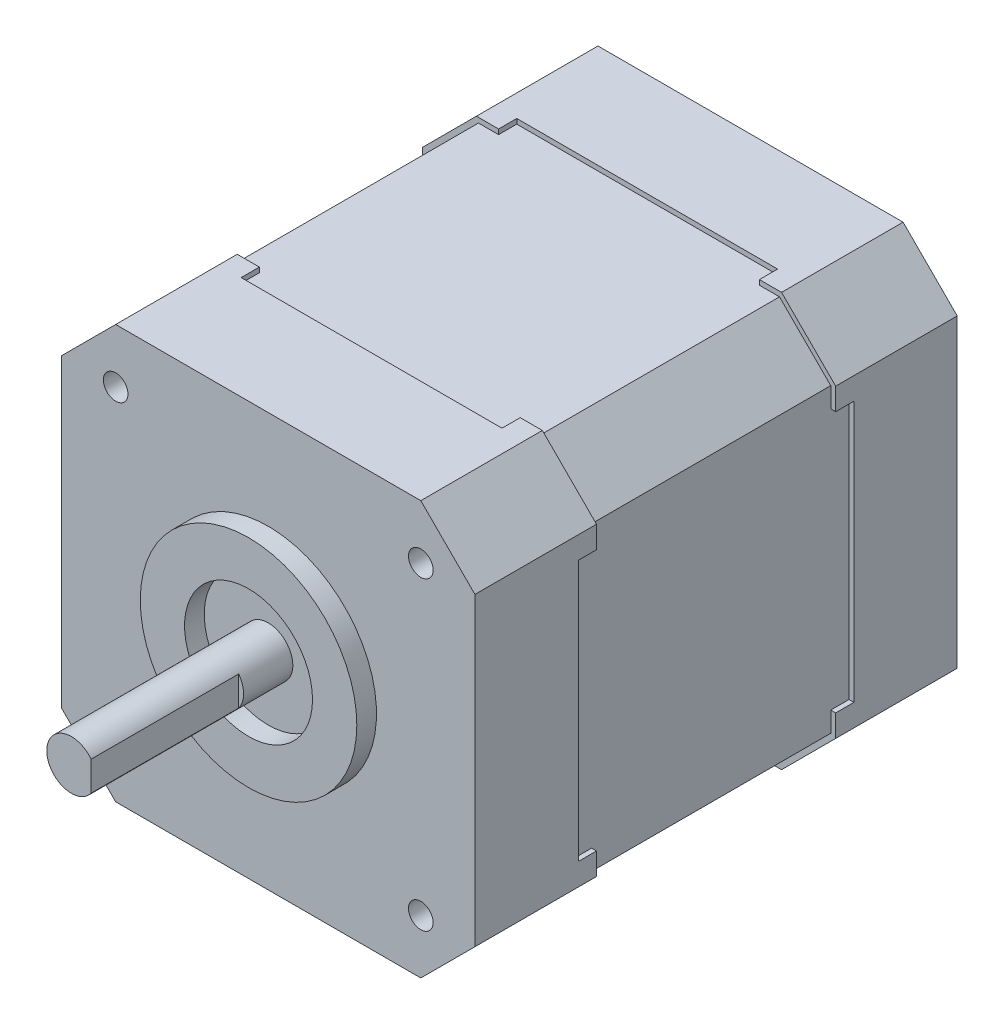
ISO-10303-21;
HEADER;
FILE_DESCRIPTION(('STEP AP214'),'2;1');
FILE_NAME('part.step','',(''),(''),'','','');
FILE_SCHEMA(('AUTOMOTIVE_DESIGN { 1 0 10303 214 1 1 1 1 }'));
ENDSEC;
DATA;
#1=APPLICATION_CONTEXT('core data for automotive mechanical design processes');
#2=APPLICATION_PROTOCOL_DEFINITION('international standard','automotive_design',2000,#1);
#3=PRODUCT_CONTEXT('',#1,'mechanical');
#4=PRODUCT('Part','Part','',(#3));
#5=PRODUCT_RELATED_PRODUCT_CATEGORY('part','',(#4));
#6=PRODUCT_DEFINITION_FORMATION('','',#4);
#7=PRODUCT_DEFINITION_CONTEXT('part definition',#1,'design');
#8=PRODUCT_DEFINITION('design','',#6,#7);
#9=PRODUCT_DEFINITION_SHAPE('','',#8);
#10=(LENGTH_UNIT() NAMED_UNIT(*) SI_UNIT(.MILLI.,.METRE.));
#11=(NAMED_UNIT(*) PLANE_ANGLE_UNIT() SI_UNIT($,.RADIAN.));
#12=(NAMED_UNIT(*) SI_UNIT($,.STERADIAN.) SOLID_ANGLE_UNIT());
#13=UNCERTAINTY_MEASURE_WITH_UNIT(LENGTH_MEASURE(1.E-05),#10,'distance_accuracy_value','');
#14=(GEOMETRIC_REPRESENTATION_CONTEXT(3) GLOBAL_UNCERTAINTY_ASSIGNED_CONTEXT((#13)) GLOBAL_UNIT_ASSIGNED_CONTEXT((#10,
#11,#12)) REPRESENTATION_CONTEXT('',''));
#15=CARTESIAN_POINT('',(0.,0.,0.));
#16=DIRECTION('',(0.,0.,1.));
#17=DIRECTION('',(1.,0.,0.));
#18=AXIS2_PLACEMENT_3D('',#15,#16,#17);
#19=CARTESIAN_POINT('',(64.0067335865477,21.,-36.65));
#20=DIRECTION('',(0.,0.,1.));
#21=DIRECTION('',(1.,0.,0.));
#22=AXIS2_PLACEMENT_3D('',#19,#20,#21);
#23=PLANE('',#22);
#24=DIRECTION('',(-1.,0.,0.));
#25=VECTOR('',#24,1.);
#26=CARTESIAN_POINT('',(64.0067335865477,13.25,-36.65));
#27=LINE('',#26,#25);
#28=CARTESIAN_POINT('',(-20.5,13.25,-36.65));
#29=VERTEX_POINT('',#28);
#30=CARTESIAN_POINT('',(-21.,13.25,-36.65));
#31=VERTEX_POINT('',#30);
#32=EDGE_CURVE('E483',#29,#31,#27,.T.);
#33=ORIENTED_EDGE('',*,*,#32,.F.);
#34=DIRECTION('',(0.,1.,0.));
#35=VECTOR('',#34,1.);
#36=CARTESIAN_POINT('',(-20.5,-15.2928932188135,-36.65));
#37=LINE('',#36,#35);
#38=CARTESIAN_POINT('',(-20.5,15.2928932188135,-36.65));
#39=VERTEX_POINT('',#38);
#40=EDGE_CURVE('E618',#29,#39,#37,.T.);
#41=ORIENTED_EDGE('',*,*,#40,.T.);
#42=DIRECTION('',(0.707106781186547,0.707106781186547,0.));
#43=VECTOR('',#42,1.);
#44=CARTESIAN_POINT('',(-20.5,15.2928932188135,-36.65));
#45=LINE('',#44,#43);
#46=CARTESIAN_POINT('',(-15.2928932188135,20.5,-36.65));
#47=VERTEX_POINT('',#46);
#48=EDGE_CURVE('E613',#39,#47,#45,.T.);
#49=ORIENTED_EDGE('',*,*,#48,.T.);
#50=DIRECTION('',(-1.,0.,0.));
#51=VECTOR('',#50,1.);
#52=CARTESIAN_POINT('',(64.0067335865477,20.5,-36.65));
#53=LINE('',#52,#51);
#54=CARTESIAN_POINT('',(-13.25,20.5,-36.65));
#55=VERTEX_POINT('',#54);
#56=EDGE_CURVE('E739',#55,#47,#53,.T.);
#57=ORIENTED_EDGE('',*,*,#56,.F.);
#58=DIRECTION('',(0.,-1.,0.));
#59=VECTOR('',#58,1.);
#60=CARTESIAN_POINT('',(-13.25,21.,-36.65));
#61=LINE('',#60,#59);
#62=CARTESIAN_POINT('',(-13.25,21.,-36.65));
#63=VERTEX_POINT('',#62);
#64=EDGE_CURVE('E602',#63,#55,#61,.T.);
#65=ORIENTED_EDGE('',*,*,#64,.F.);
#66=DIRECTION('',(-1.,0.,0.));
#67=VECTOR('',#66,1.);
#68=CARTESIAN_POINT('',(64.0067335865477,21.,-36.65));
#69=LINE('',#68,#67);
#70=CARTESIAN_POINT('',(-15.5,21.,-36.65));
#71=VERTEX_POINT('',#70);
#72=EDGE_CURVE('E727',#63,#71,#69,.T.);
#73=ORIENTED_EDGE('',*,*,#72,.T.);
#74=DIRECTION('',(0.707106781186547,0.707106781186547,0.));
#75=VECTOR('',#74,1.);
#76=CARTESIAN_POINT('',(-21.,15.5,-36.65));
#77=LINE('',#76,#75);
#78=CARTESIAN_POINT('',(-21.,15.5,-36.65));
#79=VERTEX_POINT('',#78);
#80=EDGE_CURVE('E609',#79,#71,#77,.T.);
#81=ORIENTED_EDGE('',*,*,#80,.F.);
#82=DIRECTION('',(0.,1.,0.));
#83=VECTOR('',#82,1.);
#84=CARTESIAN_POINT('',(-21.,-15.5,-36.65));
#85=LINE('',#84,#83);
#86=EDGE_CURVE('E711',#31,#79,#85,.T.);
#87=ORIENTED_EDGE('',*,*,#86,.F.);
#88=EDGE_LOOP('',(#33,#41,#49,#57,#65,#73,#81,#87));
#89=FACE_BOUND('',#88,.T.);
#90=ADVANCED_FACE('F41',(#89),#23,.T.);
#91=CARTESIAN_POINT('',(64.0067335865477,21.,-12.35));
#92=DIRECTION('',(0.,0.,-1.));
#93=DIRECTION('',(-1.,0.,0.));
#94=AXIS2_PLACEMENT_3D('',#91,#92,#93);
#95=PLANE('',#94);
#96=DIRECTION('',(1.,0.,0.));
#97=VECTOR('',#96,1.);
#98=CARTESIAN_POINT('',(64.0067335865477,13.25,-12.35));
#99=LINE('',#98,#97);
#100=CARTESIAN_POINT('',(-21.,13.25,-12.35));
#101=VERTEX_POINT('',#100);
#102=CARTESIAN_POINT('',(-20.5,13.25,-12.35));
#103=VERTEX_POINT('',#102);
#104=EDGE_CURVE('E481',#101,#103,#99,.T.);
#105=ORIENTED_EDGE('',*,*,#104,.F.);
#106=DIRECTION('',(0.,1.,0.));
#107=VECTOR('',#106,1.);
#108=CARTESIAN_POINT('',(-21.,-15.5,-12.35));
#109=LINE('',#108,#107);
#110=CARTESIAN_POINT('',(-21.,15.5,-12.35));
#111=VERTEX_POINT('',#110);
#112=EDGE_CURVE('E707',#101,#111,#109,.T.);
#113=ORIENTED_EDGE('',*,*,#112,.T.);
#114=DIRECTION('',(0.707106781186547,0.707106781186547,0.));
#115=VECTOR('',#114,1.);
#116=CARTESIAN_POINT('',(-21.,15.5,-12.35));
#117=LINE('',#116,#115);
#118=CARTESIAN_POINT('',(-15.5,21.,-12.35));
#119=VERTEX_POINT('',#118);
#120=EDGE_CURVE('E719',#111,#119,#117,.T.);
#121=ORIENTED_EDGE('',*,*,#120,.T.);
#122=DIRECTION('',(-1.,0.,0.));
#123=VECTOR('',#122,1.);
#124=CARTESIAN_POINT('',(64.0067335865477,21.,-12.35));
#125=LINE('',#124,#123);
#126=CARTESIAN_POINT('',(-13.25,21.,-12.35));
#127=VERTEX_POINT('',#126);
#128=EDGE_CURVE('E604',#127,#119,#125,.T.);
#129=ORIENTED_EDGE('',*,*,#128,.F.);
#130=DIRECTION('',(0.,1.,0.));
#131=VECTOR('',#130,1.);
#132=CARTESIAN_POINT('',(-13.25,21.,-12.35));
#133=LINE('',#132,#131);
#134=CARTESIAN_POINT('',(-13.25,20.5,-12.35));
#135=VERTEX_POINT('',#134);
#136=EDGE_CURVE('E600',#135,#127,#133,.T.);
#137=ORIENTED_EDGE('',*,*,#136,.F.);
#138=DIRECTION('',(-1.,0.,0.));
#139=VECTOR('',#138,1.);
#140=CARTESIAN_POINT('',(64.0067335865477,20.5,-12.35));
#141=LINE('',#140,#139);
#142=CARTESIAN_POINT('',(-15.2928932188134,20.5,-12.35));
#143=VERTEX_POINT('',#142);
#144=EDGE_CURVE('E736',#135,#143,#141,.T.);
#145=ORIENTED_EDGE('',*,*,#144,.T.);
#146=DIRECTION('',(0.707106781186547,0.707106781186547,0.));
#147=VECTOR('',#146,1.);
#148=CARTESIAN_POINT('',(-20.5,15.2928932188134,-12.35));
#149=LINE('',#148,#147);
#150=CARTESIAN_POINT('',(-20.5,15.2928932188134,-12.35));
#151=VERTEX_POINT('',#150);
#152=EDGE_CURVE('E716',#151,#143,#149,.T.);
#153=ORIENTED_EDGE('',*,*,#152,.F.);
#154=DIRECTION('',(0.,1.,0.));
#155=VECTOR('',#154,1.);
#156=CARTESIAN_POINT('',(-20.5,-15.2928932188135,-12.35));
#157=LINE('',#156,#155);
#158=EDGE_CURVE('E703',#103,#151,#157,.T.);
#159=ORIENTED_EDGE('',*,*,#158,.F.);
#160=EDGE_LOOP('',(#105,#113,#121,#129,#137,#145,#153,#159));
#161=FACE_BOUND('',#160,.T.);
#162=ADVANCED_FACE('F1033',(#161),#95,.T.);
#163=DIRECTION('',(1.,0.,0.));
#164=VECTOR('',#163,1.);
#165=CARTESIAN_POINT('',(64.0067335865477,-13.25,-36.65));
#166=LINE('',#165,#164);
#167=CARTESIAN_POINT('',(-21.,-13.25,-36.65));
#168=VERTEX_POINT('',#167);
#169=CARTESIAN_POINT('',(-20.5,-13.25,-36.65));
#170=VERTEX_POINT('',#169);
#171=EDGE_CURVE('E479',#168,#170,#166,.T.);
#172=ORIENTED_EDGE('',*,*,#171,.F.);
#173=CARTESIAN_POINT('',(-21.,-15.5,-36.65));
#174=VERTEX_POINT('',#173);
#175=EDGE_CURVE('E614',#174,#168,#85,.T.);
#176=ORIENTED_EDGE('',*,*,#175,.F.);
#177=DIRECTION('',(-0.707106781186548,0.707106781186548,0.));
#178=VECTOR('',#177,1.);
#179=CARTESIAN_POINT('',(-15.5,-21.,-36.65));
#180=LINE('',#179,#178);
#181=CARTESIAN_POINT('',(-15.5,-21.,-36.65));
#182=VERTEX_POINT('',#181);
#183=EDGE_CURVE('E695',#182,#174,#180,.T.);
#184=ORIENTED_EDGE('',*,*,#183,.F.);
#185=DIRECTION('',(-1.,0.,0.));
#186=VECTOR('',#185,1.);
#187=CARTESIAN_POINT('',(15.5,-21.,-36.65));
#188=LINE('',#187,#186);
#189=CARTESIAN_POINT('',(-13.25,-21.,-36.65));
#190=VERTEX_POINT('',#189);
#191=EDGE_CURVE('E684',#190,#182,#188,.T.);
#192=ORIENTED_EDGE('',*,*,#191,.F.);
#193=DIRECTION('',(0.,-1.,0.));
#194=VECTOR('',#193,1.);
#195=CARTESIAN_POINT('',(-13.25,21.,-36.65));
#196=LINE('',#195,#194);
#197=CARTESIAN_POINT('',(-13.25,-20.5,-36.65));
#198=VERTEX_POINT('',#197);
#199=EDGE_CURVE('E522',#198,#190,#196,.T.);
#200=ORIENTED_EDGE('',*,*,#199,.F.);
#201=DIRECTION('',(-1.,0.,0.));
#202=VECTOR('',#201,1.);
#203=CARTESIAN_POINT('',(15.2928932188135,-20.5,-36.65));
#204=LINE('',#203,#202);
#205=CARTESIAN_POINT('',(-15.2928932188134,-20.5,-36.65));
#206=VERTEX_POINT('',#205);
#207=EDGE_CURVE('E688',#198,#206,#204,.T.);
#208=ORIENTED_EDGE('',*,*,#207,.T.);
#209=DIRECTION('',(-0.707106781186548,0.707106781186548,0.));
#210=VECTOR('',#209,1.);
#211=CARTESIAN_POINT('',(-15.2928932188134,-20.5,-36.65));
#212=LINE('',#211,#210);
#213=CARTESIAN_POINT('',(-20.5,-15.2928932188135,-36.65));
#214=VERTEX_POINT('',#213);
#215=EDGE_CURVE('E619',#206,#214,#212,.T.);
#216=ORIENTED_EDGE('',*,*,#215,.T.);
#217=EDGE_CURVE('E700',#214,#170,#37,.T.);
#218=ORIENTED_EDGE('',*,*,#217,.T.);
#219=EDGE_LOOP('',(#172,#176,#184,#192,#200,#208,#216,#218));
#220=FACE_BOUND('',#219,.T.);
#221=ADVANCED_FACE('F916',(#220),#23,.T.);
#222=DIRECTION('',(-1.,0.,0.));
#223=VECTOR('',#222,1.);
#224=CARTESIAN_POINT('',(64.0067335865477,-13.25,-12.35));
#225=LINE('',#224,#223);
#226=CARTESIAN_POINT('',(-20.5,-13.25,-12.35));
#227=VERTEX_POINT('',#226);
#228=CARTESIAN_POINT('',(-21.,-13.25,-12.35));
#229=VERTEX_POINT('',#228);
#230=EDGE_CURVE('E56',#227,#229,#225,.T.);
#231=ORIENTED_EDGE('',*,*,#230,.F.);
#232=CARTESIAN_POINT('',(-20.5,-15.2928932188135,-12.35));
#233=VERTEX_POINT('',#232);
#234=EDGE_CURVE('E704',#233,#227,#157,.T.);
#235=ORIENTED_EDGE('',*,*,#234,.F.);
#236=DIRECTION('',(-0.707106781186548,0.707106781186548,0.));
#237=VECTOR('',#236,1.);
#238=CARTESIAN_POINT('',(-15.2928932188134,-20.5,-12.35));
#239=LINE('',#238,#237);
#240=CARTESIAN_POINT('',(-15.2928932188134,-20.5,-12.35));
#241=VERTEX_POINT('',#240);
#242=EDGE_CURVE('E623',#241,#233,#239,.T.);
#243=ORIENTED_EDGE('',*,*,#242,.F.);
#244=DIRECTION('',(-1.,0.,0.));
#245=VECTOR('',#244,1.);
#246=CARTESIAN_POINT('',(15.2928932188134,-20.5,-12.35));
#247=LINE('',#246,#245);
#248=CARTESIAN_POINT('',(-13.25,-20.5,-12.35));
#249=VERTEX_POINT('',#248);
#250=EDGE_CURVE('E676',#249,#241,#247,.T.);
#251=ORIENTED_EDGE('',*,*,#250,.F.);
#252=DIRECTION('',(0.,1.,0.));
#253=VECTOR('',#252,1.);
#254=CARTESIAN_POINT('',(-13.25,21.,-12.35));
#255=LINE('',#254,#253);
#256=CARTESIAN_POINT('',(-13.25,-21.,-12.35));
#257=VERTEX_POINT('',#256);
#258=EDGE_CURVE('E519',#257,#249,#255,.T.);
#259=ORIENTED_EDGE('',*,*,#258,.F.);
#260=DIRECTION('',(-1.,0.,0.));
#261=VECTOR('',#260,1.);
#262=CARTESIAN_POINT('',(15.5,-21.,-12.35));
#263=LINE('',#262,#261);
#264=CARTESIAN_POINT('',(-15.5,-21.,-12.35));
#265=VERTEX_POINT('',#264);
#266=EDGE_CURVE('E680',#257,#265,#263,.T.);
#267=ORIENTED_EDGE('',*,*,#266,.T.);
#268=DIRECTION('',(-0.707106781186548,0.707106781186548,0.));
#269=VECTOR('',#268,1.);
#270=CARTESIAN_POINT('',(-15.5,-21.,-12.35));
#271=LINE('',#270,#269);
#272=CARTESIAN_POINT('',(-21.,-15.5,-12.35));
#273=VERTEX_POINT('',#272);
#274=EDGE_CURVE('E693',#265,#273,#271,.T.);
#275=ORIENTED_EDGE('',*,*,#274,.T.);
#276=EDGE_CURVE('E708',#273,#229,#109,.T.);
#277=ORIENTED_EDGE('',*,*,#276,.T.);
#278=EDGE_LOOP('',(#231,#235,#243,#251,#259,#267,#275,#277));
#279=FACE_BOUND('',#278,.T.);
#280=ADVANCED_FACE('F992',(#279),#95,.T.);
#281=DIRECTION('',(-1.,0.,0.));
#282=VECTOR('',#281,1.);
#283=CARTESIAN_POINT('',(64.0067335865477,13.25,-36.65));
#284=LINE('',#283,#282);
#285=CARTESIAN_POINT('',(21.,13.25,-36.65));
#286=VERTEX_POINT('',#285);
#287=CARTESIAN_POINT('',(20.5,13.25,-36.65));
#288=VERTEX_POINT('',#287);
#289=EDGE_CURVE('E562',#286,#288,#284,.T.);
#290=ORIENTED_EDGE('',*,*,#289,.F.);
#291=DIRECTION('',(0.,-1.,0.));
#292=VECTOR('',#291,1.);
#293=CARTESIAN_POINT('',(21.,15.5,-36.65));
#294=LINE('',#293,#292);
#295=CARTESIAN_POINT('',(21.,15.5,-36.65));
#296=VERTEX_POINT('',#295);
#297=EDGE_CURVE('E648',#296,#286,#294,.T.);
#298=ORIENTED_EDGE('',*,*,#297,.F.);
#299=DIRECTION('',(0.707106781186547,-0.707106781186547,0.));
#300=VECTOR('',#299,1.);
#301=CARTESIAN_POINT('',(15.5,21.,-36.65));
#302=LINE('',#301,#300);
#303=CARTESIAN_POINT('',(15.5,21.,-36.65));
#304=VERTEX_POINT('',#303);
#305=EDGE_CURVE('E633',#304,#296,#302,.T.);
#306=ORIENTED_EDGE('',*,*,#305,.F.);
#307=CARTESIAN_POINT('',(13.25,21.,-36.65));
#308=VERTEX_POINT('',#307);
#309=EDGE_CURVE('E730',#304,#308,#69,.T.);
#310=ORIENTED_EDGE('',*,*,#309,.T.);
#311=DIRECTION('',(0.,1.,0.));
#312=VECTOR('',#311,1.);
#313=CARTESIAN_POINT('',(13.25,21.,-36.65));
#314=LINE('',#313,#312);
#315=CARTESIAN_POINT('',(13.25,20.5,-36.65));
#316=VERTEX_POINT('',#315);
#317=EDGE_CURVE('E598',#316,#308,#314,.T.);
#318=ORIENTED_EDGE('',*,*,#317,.F.);
#319=CARTESIAN_POINT('',(15.2928932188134,20.5,-36.65));
#320=VERTEX_POINT('',#319);
#321=EDGE_CURVE('E742',#320,#316,#53,.T.);
#322=ORIENTED_EDGE('',*,*,#321,.F.);
#323=DIRECTION('',(0.707106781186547,-0.707106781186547,0.));
#324=VECTOR('',#323,1.);
#325=CARTESIAN_POINT('',(15.2928932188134,20.5,-36.65));
#326=LINE('',#325,#324);
#327=CARTESIAN_POINT('',(20.5,15.2928932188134,-36.65));
#328=VERTEX_POINT('',#327);
#329=EDGE_CURVE('E637',#320,#328,#326,.T.);
#330=ORIENTED_EDGE('',*,*,#329,.T.);
#331=DIRECTION('',(0.,-1.,0.));
#332=VECTOR('',#331,1.);
#333=CARTESIAN_POINT('',(20.5,15.2928932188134,-36.65));
#334=LINE('',#333,#332);
#335=EDGE_CURVE('E652',#328,#288,#334,.T.);
#336=ORIENTED_EDGE('',*,*,#335,.T.);
#337=EDGE_LOOP('',(#290,#298,#306,#310,#318,#322,#330,#336));
#338=FACE_BOUND('',#337,.T.);
#339=ADVANCED_FACE('F882',(#338),#23,.T.);
#340=DIRECTION('',(1.,0.,0.));
#341=VECTOR('',#340,1.);
#342=CARTESIAN_POINT('',(64.0067335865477,13.25,-12.35));
#343=LINE('',#342,#341);
#344=CARTESIAN_POINT('',(20.5,13.25,-12.35));
#345=VERTEX_POINT('',#344);
#346=CARTESIAN_POINT('',(21.,13.25,-12.35));
#347=VERTEX_POINT('',#346);
#348=EDGE_CURVE('E560',#345,#347,#343,.T.);
#349=ORIENTED_EDGE('',*,*,#348,.F.);
#350=DIRECTION('',(0.,-1.,0.));
#351=VECTOR('',#350,1.);
#352=CARTESIAN_POINT('',(20.5,15.2928932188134,-12.35));
#353=LINE('',#352,#351);
#354=CARTESIAN_POINT('',(20.5,15.2928932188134,-12.35));
#355=VERTEX_POINT('',#354);
#356=EDGE_CURVE('E656',#355,#345,#353,.T.);
#357=ORIENTED_EDGE('',*,*,#356,.F.);
#358=DIRECTION('',(0.707106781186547,-0.707106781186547,0.));
#359=VECTOR('',#358,1.);
#360=CARTESIAN_POINT('',(15.2928932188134,20.5,-12.35));
#361=LINE('',#360,#359);
#362=CARTESIAN_POINT('',(15.2928932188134,20.5,-12.35));
#363=VERTEX_POINT('',#362);
#364=EDGE_CURVE('E640',#363,#355,#361,.T.);
#365=ORIENTED_EDGE('',*,*,#364,.F.);
#366=CARTESIAN_POINT('',(13.25,20.5,-12.35));
#367=VERTEX_POINT('',#366);
#368=EDGE_CURVE('E634',#363,#367,#141,.T.);
#369=ORIENTED_EDGE('',*,*,#368,.T.);
#370=DIRECTION('',(0.,-1.,0.));
#371=VECTOR('',#370,1.);
#372=CARTESIAN_POINT('',(13.25,21.,-12.35));
#373=LINE('',#372,#371);
#374=CARTESIAN_POINT('',(13.25,21.,-12.35));
#375=VERTEX_POINT('',#374);
#376=EDGE_CURVE('E595',#375,#367,#373,.T.);
#377=ORIENTED_EDGE('',*,*,#376,.F.);
#378=CARTESIAN_POINT('',(15.5,21.,-12.35));
#379=VERTEX_POINT('',#378);
#380=EDGE_CURVE('E724',#379,#375,#125,.T.);
#381=ORIENTED_EDGE('',*,*,#380,.F.);
#382=DIRECTION('',(0.707106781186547,-0.707106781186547,0.));
#383=VECTOR('',#382,1.);
#384=CARTESIAN_POINT('',(15.5,21.,-12.35));
#385=LINE('',#384,#383);
#386=CARTESIAN_POINT('',(21.,15.5,-12.35));
#387=VERTEX_POINT('',#386);
#388=EDGE_CURVE('E629',#379,#387,#385,.T.);
#389=ORIENTED_EDGE('',*,*,#388,.T.);
#390=DIRECTION('',(0.,-1.,0.));
#391=VECTOR('',#390,1.);
#392=CARTESIAN_POINT('',(21.,15.5,-12.35));
#393=LINE('',#392,#391);
#394=EDGE_CURVE('E644',#387,#347,#393,.T.);
#395=ORIENTED_EDGE('',*,*,#394,.T.);
#396=EDGE_LOOP('',(#349,#357,#365,#369,#377,#381,#389,#395));
#397=FACE_BOUND('',#396,.T.);
#398=ADVANCED_FACE('F1050',(#397),#95,.T.);
#399=CARTESIAN_POINT('',(-15.5,21.,-49.));
#400=DIRECTION('',(0.,1.,0.));
#401=DIRECTION('',(0.,0.,1.));
#402=AXIS2_PLACEMENT_3D('',#399,#400,#401);
#403=PLANE('',#402);
#404=DIRECTION('',(0.,0.,1.));
#405=VECTOR('',#404,1.);
#406=CARTESIAN_POINT('',(-13.25,21.,-38.5));
#407=LINE('',#406,#405);
#408=CARTESIAN_POINT('',(-13.25,21.,-10.5));
#409=VERTEX_POINT('',#408);
#410=EDGE_CURVE('E564',#127,#409,#407,.T.);
#411=ORIENTED_EDGE('',*,*,#410,.F.);
#412=ORIENTED_EDGE('',*,*,#128,.T.);
#413=DIRECTION('',(0.,0.,1.));
#414=VECTOR('',#413,1.);
#415=CARTESIAN_POINT('',(-15.5,21.,-49.));
#416=LINE('',#415,#414);
#417=CARTESIAN_POINT('',(-15.5,21.,0.));
#418=VERTEX_POINT('',#417);
#419=EDGE_CURVE('E797',#119,#418,#416,.T.);
#420=ORIENTED_EDGE('',*,*,#419,.T.);
#421=DIRECTION('',(-1.,0.,0.));
#422=VECTOR('',#421,1.);
#423=CARTESIAN_POINT('',(-15.5,21.,0.));
#424=LINE('',#423,#422);
#425=CARTESIAN_POINT('',(15.5,21.,0.));
#426=VERTEX_POINT('',#425);
#427=EDGE_CURVE('E771',#426,#418,#424,.T.);
#428=ORIENTED_EDGE('',*,*,#427,.F.);
#429=DIRECTION('',(0.,0.,1.));
#430=VECTOR('',#429,1.);
#431=CARTESIAN_POINT('',(15.5,21.,-49.));
#432=LINE('',#431,#430);
#433=EDGE_CURVE('E824',#379,#426,#432,.T.);
#434=ORIENTED_EDGE('',*,*,#433,.F.);
#435=ORIENTED_EDGE('',*,*,#380,.T.);
#436=DIRECTION('',(0.,0.,-1.));
#437=VECTOR('',#436,1.);
#438=CARTESIAN_POINT('',(13.25,21.,-38.5));
#439=LINE('',#438,#437);
#440=CARTESIAN_POINT('',(13.25,21.,-10.5));
#441=VERTEX_POINT('',#440);
#442=EDGE_CURVE('E579',#441,#375,#439,.T.);
#443=ORIENTED_EDGE('',*,*,#442,.F.);
#444=DIRECTION('',(1.,0.,0.));
#445=VECTOR('',#444,1.);
#446=CARTESIAN_POINT('',(-13.25,21.,-10.5));
#447=LINE('',#446,#445);
#448=EDGE_CURVE('E576',#409,#441,#447,.T.);
#449=ORIENTED_EDGE('',*,*,#448,.F.);
#450=EDGE_LOOP('',(#411,#412,#420,#428,#434,#435,#443,#449));
#451=FACE_BOUND('',#450,.T.);
#452=ADVANCED_FACE('F1055',(#451),#403,.T.);
#453=CARTESIAN_POINT('',(15.5,21.,-49.));
#454=DIRECTION('',(0.707106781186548,0.707106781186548,0.));
#455=DIRECTION('',(-0.707106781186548,0.707106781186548,0.));
#456=AXIS2_PLACEMENT_3D('',#453,#454,#455);
#457=PLANE('',#456);
#458=DIRECTION('',(0.,0.,1.));
#459=VECTOR('',#458,1.);
#460=CARTESIAN_POINT('',(21.,15.5,-49.));
#461=LINE('',#460,#459);
#462=CARTESIAN_POINT('',(21.,15.5,0.));
#463=VERTEX_POINT('',#462);
#464=EDGE_CURVE('E828',#387,#463,#461,.T.);
#465=ORIENTED_EDGE('',*,*,#464,.F.);
#466=ORIENTED_EDGE('',*,*,#388,.F.);
#467=ORIENTED_EDGE('',*,*,#433,.T.);
#468=DIRECTION('',(-0.707106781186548,0.707106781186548,0.));
#469=VECTOR('',#468,1.);
#470=CARTESIAN_POINT('',(15.5,21.,0.));
#471=LINE('',#470,#469);
#472=EDGE_CURVE('E776',#463,#426,#471,.T.);
#473=ORIENTED_EDGE('',*,*,#472,.F.);
#474=EDGE_LOOP('',(#465,#466,#467,#473));
#475=FACE_BOUND('',#474,.T.);
#476=ADVANCED_FACE('F1112',(#475),#457,.T.);
#477=CARTESIAN_POINT('',(21.,15.5,-49.));
#478=DIRECTION('',(1.,0.,0.));
#479=DIRECTION('',(0.,1.,0.));
#480=AXIS2_PLACEMENT_3D('',#477,#478,#479);
#481=PLANE('',#480);
#482=DIRECTION('',(0.,0.,1.));
#483=VECTOR('',#482,1.);
#484=CARTESIAN_POINT('',(21.,13.25,-10.5));
#485=LINE('',#484,#483);
#486=CARTESIAN_POINT('',(21.,13.25,-10.5));
#487=VERTEX_POINT('',#486);
#488=EDGE_CURVE('E541',#347,#487,#485,.T.);
#489=ORIENTED_EDGE('',*,*,#488,.F.);
#490=ORIENTED_EDGE('',*,*,#394,.F.);
#491=ORIENTED_EDGE('',*,*,#464,.T.);
#492=DIRECTION('',(0.,1.,0.));
#493=VECTOR('',#492,1.);
#494=CARTESIAN_POINT('',(21.,15.5,0.));
#495=LINE('',#494,#493);
#496=CARTESIAN_POINT('',(21.,-15.5,0.));
#497=VERTEX_POINT('',#496);
#498=EDGE_CURVE('E815',#497,#463,#495,.T.);
#499=ORIENTED_EDGE('',*,*,#498,.F.);
#500=DIRECTION('',(0.,0.,1.));
#501=VECTOR('',#500,1.);
#502=CARTESIAN_POINT('',(21.,-15.5,-49.));
#503=LINE('',#502,#501);
#504=CARTESIAN_POINT('',(21.,-15.5,-12.35));
#505=VERTEX_POINT('',#504);
#506=EDGE_CURVE('E832',#505,#497,#503,.T.);
#507=ORIENTED_EDGE('',*,*,#506,.F.);
#508=CARTESIAN_POINT('',(21.,-13.25,-12.35));
#509=VERTEX_POINT('',#508);
#510=EDGE_CURVE('E628',#509,#505,#393,.T.);
#511=ORIENTED_EDGE('',*,*,#510,.F.);
#512=DIRECTION('',(0.,0.,-1.));
#513=VECTOR('',#512,1.);
#514=CARTESIAN_POINT('',(21.,-13.25,-10.5));
#515=LINE('',#514,#513);
#516=CARTESIAN_POINT('',(21.,-13.25,-10.5));
#517=VERTEX_POINT('',#516);
#518=EDGE_CURVE('E536',#517,#509,#515,.T.);
#519=ORIENTED_EDGE('',*,*,#518,.F.);
#520=DIRECTION('',(0.,-1.,0.));
#521=VECTOR('',#520,1.);
#522=CARTESIAN_POINT('',(21.,13.25,-10.5));
#523=LINE('',#522,#521);
#524=EDGE_CURVE('E524',#487,#517,#523,.T.);
#525=ORIENTED_EDGE('',*,*,#524,.F.);
#526=EDGE_LOOP('',(#489,#490,#491,#499,#507,#511,#519,#525));
#527=FACE_BOUND('',#526,.T.);
#528=ADVANCED_FACE('F1115',(#527),#481,.T.);
#529=CARTESIAN_POINT('',(15.5,-21.,-49.));
#530=DIRECTION('',(0.707106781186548,-0.707106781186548,0.));
#531=DIRECTION('',(0.707106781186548,0.707106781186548,0.));
#532=AXIS2_PLACEMENT_3D('',#529,#530,#531);
#533=PLANE('',#532);
#534=DIRECTION('',(0.,0.,1.));
#535=VECTOR('',#534,1.);
#536=CARTESIAN_POINT('',(15.5,-21.,-49.));
#537=LINE('',#536,#535);
#538=CARTESIAN_POINT('',(15.5,-21.,-12.35));
#539=VERTEX_POINT('',#538);
#540=CARTESIAN_POINT('',(15.5,-21.,0.));
#541=VERTEX_POINT('',#540);
#542=EDGE_CURVE('E836',#539,#541,#537,.T.);
#543=ORIENTED_EDGE('',*,*,#542,.F.);
#544=DIRECTION('',(-0.707106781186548,-0.707106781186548,0.));
#545=VECTOR('',#544,1.);
#546=CARTESIAN_POINT('',(21.,-15.5,-12.35));
#547=LINE('',#546,#545);
#548=EDGE_CURVE('E662',#505,#539,#547,.T.);
#549=ORIENTED_EDGE('',*,*,#548,.F.);
#550=ORIENTED_EDGE('',*,*,#506,.T.);
#551=DIRECTION('',(0.707106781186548,0.707106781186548,0.));
#552=VECTOR('',#551,1.);
#553=CARTESIAN_POINT('',(15.5,-21.,0.));
#554=LINE('',#553,#552);
#555=EDGE_CURVE('E812',#541,#497,#554,.T.);
#556=ORIENTED_EDGE('',*,*,#555,.F.);
#557=EDGE_LOOP('',(#543,#549,#550,#556));
#558=FACE_BOUND('',#557,.T.);
#559=ADVANCED_FACE('F1118',(#558),#533,.T.);
#560=CARTESIAN_POINT('',(-15.5,-21.,-49.));
#561=DIRECTION('',(0.,-1.,0.));
#562=DIRECTION('',(1.,0.,0.));
#563=AXIS2_PLACEMENT_3D('',#560,#561,#562);
#564=PLANE('',#563);
#565=DIRECTION('',(0.,0.,-1.));
#566=VECTOR('',#565,1.);
#567=CARTESIAN_POINT('',(-13.25,-21.,-10.5));
#568=LINE('',#567,#566);
#569=CARTESIAN_POINT('',(-13.25,-21.,-10.5));
#570=VERTEX_POINT('',#569);
#571=EDGE_CURVE('E485',#570,#257,#568,.T.);
#572=ORIENTED_EDGE('',*,*,#571,.F.);
#573=DIRECTION('',(-1.,0.,0.));
#574=VECTOR('',#573,1.);
#575=CARTESIAN_POINT('',(-13.25,-21.,-10.5));
#576=LINE('',#575,#574);
#577=CARTESIAN_POINT('',(13.25,-21.,-10.5));
#578=VERTEX_POINT('',#577);
#579=EDGE_CURVE('E502',#578,#570,#576,.T.);
#580=ORIENTED_EDGE('',*,*,#579,.F.);
#581=DIRECTION('',(0.,0.,1.));
#582=VECTOR('',#581,1.);
#583=CARTESIAN_POINT('',(13.25,-21.,-10.5));
#584=LINE('',#583,#582);
#585=CARTESIAN_POINT('',(13.25,-21.,-12.35));
#586=VERTEX_POINT('',#585);
#587=EDGE_CURVE('E499',#586,#578,#584,.T.);
#588=ORIENTED_EDGE('',*,*,#587,.F.);
#589=EDGE_CURVE('E681',#539,#586,#263,.T.);
#590=ORIENTED_EDGE('',*,*,#589,.F.);
#591=ORIENTED_EDGE('',*,*,#542,.T.);
#592=DIRECTION('',(1.,0.,0.));
#593=VECTOR('',#592,1.);
#594=CARTESIAN_POINT('',(-15.5,-21.,0.));
#595=LINE('',#594,#593);
#596=CARTESIAN_POINT('',(-15.5,-21.,0.));
#597=VERTEX_POINT('',#596);
#598=EDGE_CURVE('E809',#597,#541,#595,.T.);
#599=ORIENTED_EDGE('',*,*,#598,.F.);
#600=DIRECTION('',(0.,0.,1.));
#601=VECTOR('',#600,1.);
#602=CARTESIAN_POINT('',(-15.5,-21.,-49.));
#603=LINE('',#602,#601);
#604=EDGE_CURVE('E840',#265,#597,#603,.T.);
#605=ORIENTED_EDGE('',*,*,#604,.F.);
#606=ORIENTED_EDGE('',*,*,#266,.F.);
#607=EDGE_LOOP('',(#572,#580,#588,#590,#591,#599,#605,#606));
#608=FACE_BOUND('',#607,.T.);
#609=ADVANCED_FACE('F983',(#608),#564,.T.);
#610=CARTESIAN_POINT('',(-21.,-15.5,-49.));
#611=DIRECTION('',(-0.707106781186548,-0.707106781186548,0.));
#612=DIRECTION('',(0.707106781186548,-0.707106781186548,0.));
#613=AXIS2_PLACEMENT_3D('',#610,#611,#612);
#614=PLANE('',#613);
#615=DIRECTION('',(0.,0.,1.));
#616=VECTOR('',#615,1.);
#617=CARTESIAN_POINT('',(-21.,-15.5,-49.));
#618=LINE('',#617,#616);
#619=CARTESIAN_POINT('',(-21.,-15.5,0.));
#620=VERTEX_POINT('',#619);
#621=EDGE_CURVE('E844',#273,#620,#618,.T.);
#622=ORIENTED_EDGE('',*,*,#621,.F.);
#623=ORIENTED_EDGE('',*,*,#274,.F.);
#624=ORIENTED_EDGE('',*,*,#604,.T.);
#625=DIRECTION('',(0.707106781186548,-0.707106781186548,0.));
#626=VECTOR('',#625,1.);
#627=CARTESIAN_POINT('',(-21.,-15.5,0.));
#628=LINE('',#627,#626);
#629=EDGE_CURVE('E806',#620,#597,#628,.T.);
#630=ORIENTED_EDGE('',*,*,#629,.F.);
#631=EDGE_LOOP('',(#622,#623,#624,#630));
#632=FACE_BOUND('',#631,.T.);
#633=ADVANCED_FACE('F1123',(#632),#614,.T.);
#634=CARTESIAN_POINT('',(-21.,15.5,-49.));
#635=DIRECTION('',(-1.,0.,0.));
#636=DIRECTION('',(0.,-1.,0.));
#637=AXIS2_PLACEMENT_3D('',#634,#635,#636);
#638=PLANE('',#637);
#639=DIRECTION('',(0.,0.,-1.));
#640=VECTOR('',#639,1.);
#641=CARTESIAN_POINT('',(-21.,13.25,-38.5));
#642=LINE('',#641,#640);
#643=CARTESIAN_POINT('',(-21.,13.25,-10.5));
#644=VERTEX_POINT('',#643);
#645=EDGE_CURVE('E466',#644,#101,#642,.T.);
#646=ORIENTED_EDGE('',*,*,#645,.F.);
#647=DIRECTION('',(0.,1.,0.));
#648=VECTOR('',#647,1.);
#649=CARTESIAN_POINT('',(-21.,13.25,-10.5));
#650=LINE('',#649,#648);
#651=CARTESIAN_POINT('',(-21.,-13.25,-10.5));
#652=VERTEX_POINT('',#651);
#653=EDGE_CURVE('E463',#652,#644,#650,.T.);
#654=ORIENTED_EDGE('',*,*,#653,.F.);
#655=DIRECTION('',(0.,0.,1.));
#656=VECTOR('',#655,1.);
#657=CARTESIAN_POINT('',(-21.,-13.25,-38.5));
#658=LINE('',#657,#656);
#659=EDGE_CURVE('E460',#229,#652,#658,.T.);
#660=ORIENTED_EDGE('',*,*,#659,.F.);
#661=ORIENTED_EDGE('',*,*,#276,.F.);
#662=ORIENTED_EDGE('',*,*,#621,.T.);
#663=DIRECTION('',(0.,-1.,0.));
#664=VECTOR('',#663,1.);
#665=CARTESIAN_POINT('',(-21.,15.5,0.));
#666=LINE('',#665,#664);
#667=CARTESIAN_POINT('',(-21.,15.5,0.));
#668=VERTEX_POINT('',#667);
#669=EDGE_CURVE('E803',#668,#620,#666,.T.);
#670=ORIENTED_EDGE('',*,*,#669,.F.);
#671=DIRECTION('',(0.,0.,1.));
#672=VECTOR('',#671,1.);
#673=CARTESIAN_POINT('',(-21.,15.5,-49.));
#674=LINE('',#673,#672);
#675=EDGE_CURVE('E848',#111,#668,#674,.T.);
#676=ORIENTED_EDGE('',*,*,#675,.F.);
#677=ORIENTED_EDGE('',*,*,#112,.F.);
#678=EDGE_LOOP('',(#646,#654,#660,#661,#662,#670,#676,#677));
#679=FACE_BOUND('',#678,.T.);
#680=ADVANCED_FACE('F1125',(#679),#638,.T.);
#681=CARTESIAN_POINT('',(-21.,15.5,-49.));
#682=DIRECTION('',(-0.707106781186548,0.707106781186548,0.));
#683=DIRECTION('',(-0.707106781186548,-0.707106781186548,0.));
#684=AXIS2_PLACEMENT_3D('',#681,#682,#683);
#685=PLANE('',#684);
#686=ORIENTED_EDGE('',*,*,#419,.F.);
#687=ORIENTED_EDGE('',*,*,#120,.F.);
#688=ORIENTED_EDGE('',*,*,#675,.T.);
#689=DIRECTION('',(-0.707106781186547,-0.707106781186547,0.));
#690=VECTOR('',#689,1.);
#691=CARTESIAN_POINT('',(-21.,15.5,0.));
#692=LINE('',#691,#690);
#693=EDGE_CURVE('E800',#418,#668,#692,.T.);
#694=ORIENTED_EDGE('',*,*,#693,.F.);
#695=EDGE_LOOP('',(#686,#687,#688,#694));
#696=FACE_BOUND('',#695,.T.);
#697=ADVANCED_FACE('F1108',(#696),#685,.T.);
#698=CARTESIAN_POINT('',(21.,21.,0.));
#699=DIRECTION('',(0.,0.,-1.));
#700=DIRECTION('',(-1.,0.,0.));
#701=AXIS2_PLACEMENT_3D('',#698,#699,#700);
#702=PLANE('',#701);
#703=CARTESIAN_POINT('',(0.,0.,0.));
#704=DIRECTION('',(0.,0.,1.));
#705=DIRECTION('',(1.,0.,0.));
#706=AXIS2_PLACEMENT_3D('',#703,#704,#705);
#707=CIRCLE('',#706,6.5);
#708=CARTESIAN_POINT('',(6.5,0.,0.));
#709=VERTEX_POINT('',#708);
#710=EDGE_CURVE('E762',#709,#709,#707,.T.);
#711=ORIENTED_EDGE('',*,*,#710,.T.);
#712=EDGE_LOOP('',(#711));
#713=FACE_BOUND('',#712,.T.);
#714=CARTESIAN_POINT('',(0.,0.,0.));
#715=DIRECTION('',(0.,0.,-1.));
#716=DIRECTION('',(-1.,0.,0.));
#717=AXIS2_PLACEMENT_3D('',#714,#715,#716);
#718=CIRCLE('',#717,2.5);
#719=CARTESIAN_POINT('',(-2.5,0.,0.));
#720=VERTEX_POINT('',#719);
#721=EDGE_CURVE('E854',#720,#720,#718,.F.);
#722=ORIENTED_EDGE('',*,*,#721,.F.);
#723=EDGE_LOOP('',(#722));
#724=FACE_BOUND('',#723,.T.);
#725=ADVANCED_FACE('F1105',(#713,#724),#702,.F.);
#726=CARTESIAN_POINT('',(-15.5,15.5,0.));
#727=DIRECTION('',(0.,0.,1.));
#728=DIRECTION('',(1.,0.,0.));
#729=AXIS2_PLACEMENT_3D('',#726,#727,#728);
#730=CIRCLE('',#729,1.25);
#731=CARTESIAN_POINT('',(-14.25,15.5,0.));
#732=VERTEX_POINT('',#731);
#733=EDGE_CURVE('E428',#732,#732,#730,.T.);
#734=ORIENTED_EDGE('',*,*,#733,.F.);
#735=EDGE_LOOP('',(#734));
#736=FACE_BOUND('',#735,.T.);
#737=CARTESIAN_POINT('',(15.5,15.5,0.));
#738=DIRECTION('',(0.,0.,1.));
#739=DIRECTION('',(1.,0.,0.));
#740=AXIS2_PLACEMENT_3D('',#737,#738,#739);
#741=CIRCLE('',#740,1.25);
#742=CARTESIAN_POINT('',(16.75,15.5,0.));
#743=VERTEX_POINT('',#742);
#744=EDGE_CURVE('E427',#743,#743,#741,.T.);
#745=ORIENTED_EDGE('',*,*,#744,.F.);
#746=EDGE_LOOP('',(#745));
#747=FACE_BOUND('',#746,.T.);
#748=CARTESIAN_POINT('',(15.5,-15.5,0.));
#749=DIRECTION('',(0.,0.,1.));
#750=DIRECTION('',(1.,0.,0.));
#751=AXIS2_PLACEMENT_3D('',#748,#749,#750);
#752=CIRCLE('',#751,1.25);
#753=CARTESIAN_POINT('',(16.75,-15.5,0.));
#754=VERTEX_POINT('',#753);
#755=EDGE_CURVE('E438',#754,#754,#752,.T.);
#756=ORIENTED_EDGE('',*,*,#755,.F.);
#757=EDGE_LOOP('',(#756));
#758=FACE_BOUND('',#757,.T.);
#759=CARTESIAN_POINT('',(-15.5,-15.5,0.));
#760=DIRECTION('',(0.,0.,1.));
#761=DIRECTION('',(1.,0.,0.));
#762=AXIS2_PLACEMENT_3D('',#759,#760,#761);
#763=CIRCLE('',#762,1.25);
#764=CARTESIAN_POINT('',(-14.25,-15.5,0.));
#765=VERTEX_POINT('',#764);
#766=EDGE_CURVE('E444',#765,#765,#763,.T.);
#767=ORIENTED_EDGE('',*,*,#766,.F.);
#768=EDGE_LOOP('',(#767));
#769=FACE_BOUND('',#768,.T.);
#770=ORIENTED_EDGE('',*,*,#427,.T.);
#771=ORIENTED_EDGE('',*,*,#693,.T.);
#772=ORIENTED_EDGE('',*,*,#669,.T.);
#773=ORIENTED_EDGE('',*,*,#629,.T.);
#774=ORIENTED_EDGE('',*,*,#598,.T.);
#775=ORIENTED_EDGE('',*,*,#555,.T.);
#776=ORIENTED_EDGE('',*,*,#498,.T.);
#777=ORIENTED_EDGE('',*,*,#472,.T.);
#778=EDGE_LOOP('',(#770,#771,#772,#773,#774,#775,#776,#777));
#779=FACE_BOUND('',#778,.T.);
#780=CARTESIAN_POINT('',(0.,0.,0.));
#781=DIRECTION('',(0.,0.,-1.));
#782=DIRECTION('',(-1.,0.,0.));
#783=AXIS2_PLACEMENT_3D('',#780,#781,#782);
#784=CIRCLE('',#783,11.);
#785=CARTESIAN_POINT('',(-11.,0.,0.));
#786=VERTEX_POINT('',#785);
#787=EDGE_CURVE('E823',#786,#786,#784,.F.);
#788=ORIENTED_EDGE('',*,*,#787,.F.);
#789=EDGE_LOOP('',(#788));
#790=FACE_BOUND('',#789,.T.);
#791=ADVANCED_FACE('F1098',(#736,#747,#758,#769,#779,#790),#702,.F.);
#792=CARTESIAN_POINT('',(0.,0.,2.));
#793=DIRECTION('',(0.,0.,1.));
#794=DIRECTION('',(1.,0.,0.));
#795=AXIS2_PLACEMENT_3D('',#792,#793,#794);
#796=PLANE('',#795);
#797=CARTESIAN_POINT('',(0.,0.,2.));
#798=DIRECTION('',(0.,0.,1.));
#799=DIRECTION('',(1.,0.,0.));
#800=AXIS2_PLACEMENT_3D('',#797,#798,#799);
#801=CIRCLE('',#800,11.);
#802=CARTESIAN_POINT('',(11.,0.,2.));
#803=VERTEX_POINT('',#802);
#804=EDGE_CURVE('E766',#803,#803,#801,.T.);
#805=ORIENTED_EDGE('',*,*,#804,.T.);
#806=EDGE_LOOP('',(#805));
#807=FACE_BOUND('',#806,.T.);
#808=CARTESIAN_POINT('',(0.,0.,2.));
#809=DIRECTION('',(0.,0.,1.));
#810=DIRECTION('',(1.,0.,0.));
#811=AXIS2_PLACEMENT_3D('',#808,#809,#810);
#812=CIRCLE('',#811,6.5);
#813=CARTESIAN_POINT('',(6.5,0.,2.));
#814=VERTEX_POINT('',#813);
#815=EDGE_CURVE('E763',#814,#814,#812,.T.);
#816=ORIENTED_EDGE('',*,*,#815,.F.);
#817=EDGE_LOOP('',(#816));
#818=FACE_BOUND('',#817,.T.);
#819=ADVANCED_FACE('F1095',(#807,#818),#796,.T.);
#820=CARTESIAN_POINT('',(0.,0.,2.));
#821=DIRECTION('',(0.,0.,-1.));
#822=DIRECTION('',(-1.,0.,0.));
#823=AXIS2_PLACEMENT_3D('',#820,#821,#822);
#824=CYLINDRICAL_SURFACE('',#823,11.);
#825=ORIENTED_EDGE('',*,*,#804,.F.);
#826=EDGE_LOOP('',(#825));
#827=FACE_BOUND('',#826,.T.);
#828=ORIENTED_EDGE('',*,*,#787,.T.);
#829=EDGE_LOOP('',(#828));
#830=FACE_BOUND('',#829,.T.);
#831=ADVANCED_FACE('F1093',(#827,#830),#824,.T.);
#832=CARTESIAN_POINT('',(0.,0.,2.));
#833=DIRECTION('',(0.,0.,-1.));
#834=DIRECTION('',(-1.,0.,0.));
#835=AXIS2_PLACEMENT_3D('',#832,#833,#834);
#836=CYLINDRICAL_SURFACE('',#835,6.5);
#837=ORIENTED_EDGE('',*,*,#815,.T.);
#838=EDGE_LOOP('',(#837));
#839=FACE_BOUND('',#838,.T.);
#840=ORIENTED_EDGE('',*,*,#710,.F.);
#841=EDGE_LOOP('',(#840));
#842=FACE_BOUND('',#841,.T.);
#843=ADVANCED_FACE('F1089',(#839,#842),#836,.F.);
#844=CARTESIAN_POINT('',(0.,0.,20.));
#845=DIRECTION('',(0.,0.,-1.));
#846=DIRECTION('',(-1.,0.,0.));
#847=AXIS2_PLACEMENT_3D('',#844,#845,#846);
#848=CYLINDRICAL_SURFACE('',#847,2.5);
#849=CARTESIAN_POINT('',(0.,0.,20.));
#850=DIRECTION('',(0.,0.,1.));
#851=DIRECTION('',(1.,0.,0.));
#852=AXIS2_PLACEMENT_3D('',#849,#850,#851);
#853=CIRCLE('',#852,2.5);
#854=CARTESIAN_POINT('',(2.,1.5,20.));
#855=VERTEX_POINT('',#854);
#856=CARTESIAN_POINT('',(2.,-1.5,20.));
#857=VERTEX_POINT('',#856);
#858=EDGE_CURVE('E758',#855,#857,#853,.T.);
#859=ORIENTED_EDGE('',*,*,#858,.F.);
#860=DIRECTION('',(0.,0.,1.));
#861=VECTOR('',#860,1.);
#862=CARTESIAN_POINT('',(2.,1.5,5.));
#863=LINE('',#862,#861);
#864=CARTESIAN_POINT('',(2.,1.5,5.));
#865=VERTEX_POINT('',#864);
#866=EDGE_CURVE('E753',#865,#855,#863,.T.);
#867=ORIENTED_EDGE('',*,*,#866,.F.);
#868=CARTESIAN_POINT('',(0.,0.,5.));
#869=DIRECTION('',(0.,0.,1.));
#870=DIRECTION('',(1.,0.,0.));
#871=AXIS2_PLACEMENT_3D('',#868,#869,#870);
#872=CIRCLE('',#871,2.5);
#873=CARTESIAN_POINT('',(2.,-1.5,5.));
#874=VERTEX_POINT('',#873);
#875=EDGE_CURVE('E747',#874,#865,#872,.T.);
#876=ORIENTED_EDGE('',*,*,#875,.F.);
#877=DIRECTION('',(0.,0.,1.));
#878=VECTOR('',#877,1.);
#879=CARTESIAN_POINT('',(2.,-1.5,5.));
#880=LINE('',#879,#878);
#881=EDGE_CURVE('E755',#874,#857,#880,.T.);
#882=ORIENTED_EDGE('',*,*,#881,.T.);
#883=EDGE_LOOP('',(#859,#867,#876,#882));
#884=FACE_BOUND('',#883,.T.);
#885=ORIENTED_EDGE('',*,*,#721,.T.);
#886=EDGE_LOOP('',(#885));
#887=FACE_BOUND('',#886,.T.);
#888=ADVANCED_FACE('F1085',(#884,#887),#848,.T.);
#889=CARTESIAN_POINT('',(0.,0.,20.));
#890=DIRECTION('',(0.,0.,1.));
#891=DIRECTION('',(1.,0.,0.));
#892=AXIS2_PLACEMENT_3D('',#889,#890,#891);
#893=PLANE('',#892);
#894=DIRECTION('',(0.,-1.,0.));
#895=VECTOR('',#894,1.);
#896=CARTESIAN_POINT('',(2.,1.5,20.));
#897=LINE('',#896,#895);
#898=EDGE_CURVE('E608',#855,#857,#897,.T.);
#899=ORIENTED_EDGE('',*,*,#898,.F.);
#900=ORIENTED_EDGE('',*,*,#858,.T.);
#901=EDGE_LOOP('',(#899,#900));
#902=FACE_BOUND('',#901,.T.);
#903=ADVANCED_FACE('F1081',(#902),#893,.T.);
#904=CARTESIAN_POINT('',(2.,1.5,5.));
#905=DIRECTION('',(-1.,0.,0.));
#906=DIRECTION('',(0.,0.,1.));
#907=AXIS2_PLACEMENT_3D('',#904,#905,#906);
#908=PLANE('',#907);
#909=ORIENTED_EDGE('',*,*,#898,.T.);
#910=ORIENTED_EDGE('',*,*,#881,.F.);
#911=DIRECTION('',(0.,-1.,0.));
#912=VECTOR('',#911,1.);
#913=CARTESIAN_POINT('',(2.,1.5,5.));
#914=LINE('',#913,#912);
#915=EDGE_CURVE('E750',#865,#874,#914,.T.);
#916=ORIENTED_EDGE('',*,*,#915,.F.);
#917=ORIENTED_EDGE('',*,*,#866,.T.);
#918=EDGE_LOOP('',(#909,#910,#916,#917));
#919=FACE_BOUND('',#918,.T.);
#920=ADVANCED_FACE('F1077',(#919),#908,.F.);
#921=CARTESIAN_POINT('',(0.,0.,5.));
#922=DIRECTION('',(0.,0.,1.));
#923=DIRECTION('',(1.,0.,0.));
#924=AXIS2_PLACEMENT_3D('',#921,#922,#923);
#925=PLANE('',#924);
#926=ORIENTED_EDGE('',*,*,#875,.T.);
#927=ORIENTED_EDGE('',*,*,#915,.T.);
#928=EDGE_LOOP('',(#926,#927));
#929=FACE_BOUND('',#928,.T.);
#930=ADVANCED_FACE('F1073',(#929),#925,.T.);
#931=CARTESIAN_POINT('',(-20.5,15.2928932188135,-12.35));
#932=DIRECTION('',(0.707106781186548,-0.707106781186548,0.));
#933=DIRECTION('',(0.707106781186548,0.707106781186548,0.));
#934=AXIS2_PLACEMENT_3D('',#931,#932,#933);
#935=PLANE('',#934);
#936=ORIENTED_EDGE('',*,*,#48,.F.);
#937=DIRECTION('',(0.,0.,-1.));
#938=VECTOR('',#937,1.);
#939=CARTESIAN_POINT('',(-20.5,15.2928932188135,-12.35));
#940=LINE('',#939,#938);
#941=EDGE_CURVE('E610',#151,#39,#940,.T.);
#942=ORIENTED_EDGE('',*,*,#941,.F.);
#943=ORIENTED_EDGE('',*,*,#152,.T.);
#944=DIRECTION('',(0.,0.,1.));
#945=VECTOR('',#944,1.);
#946=CARTESIAN_POINT('',(-15.2928932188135,20.5,-12.35));
#947=LINE('',#946,#945);
#948=EDGE_CURVE('E605',#47,#143,#947,.T.);
#949=ORIENTED_EDGE('',*,*,#948,.F.);
#950=EDGE_LOOP('',(#936,#942,#943,#949));
#951=FACE_BOUND('',#950,.T.);
#952=ADVANCED_FACE('F1070',(#951),#935,.F.);
#953=CARTESIAN_POINT('',(-20.5,-15.2928932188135,-12.35));
#954=DIRECTION('',(-1.,0.,0.));
#955=DIRECTION('',(0.,-1.,0.));
#956=AXIS2_PLACEMENT_3D('',#953,#954,#955);
#957=PLANE('',#956);
#958=ORIENTED_EDGE('',*,*,#234,.T.);
#959=DIRECTION('',(0.,0.,-1.));
#960=VECTOR('',#959,1.);
#961=CARTESIAN_POINT('',(-20.5,-13.25,-38.5));
#962=LINE('',#961,#960);
#963=CARTESIAN_POINT('',(-20.5,-13.25,-10.5));
#964=VERTEX_POINT('',#963);
#965=EDGE_CURVE('E476',#964,#227,#962,.T.);
#966=ORIENTED_EDGE('',*,*,#965,.F.);
#967=DIRECTION('',(0.,-1.,0.));
#968=VECTOR('',#967,1.);
#969=CARTESIAN_POINT('',(-20.5,13.25,-10.5));
#970=LINE('',#969,#968);
#971=CARTESIAN_POINT('',(-20.5,13.25,-10.5));
#972=VERTEX_POINT('',#971);
#973=EDGE_CURVE('E450',#972,#964,#970,.T.);
#974=ORIENTED_EDGE('',*,*,#973,.F.);
#975=DIRECTION('',(0.,0.,1.));
#976=VECTOR('',#975,1.);
#977=CARTESIAN_POINT('',(-20.5,13.25,-38.5));
#978=LINE('',#977,#976);
#979=EDGE_CURVE('E452',#103,#972,#978,.T.);
#980=ORIENTED_EDGE('',*,*,#979,.F.);
#981=ORIENTED_EDGE('',*,*,#158,.T.);
#982=ORIENTED_EDGE('',*,*,#941,.T.);
#983=ORIENTED_EDGE('',*,*,#40,.F.);
#984=CARTESIAN_POINT('',(-20.5,13.25,-38.5));
#985=VERTEX_POINT('',#984);
#986=EDGE_CURVE('E454',#985,#29,#978,.T.);
#987=ORIENTED_EDGE('',*,*,#986,.F.);
#988=DIRECTION('',(0.,1.,0.));
#989=VECTOR('',#988,1.);
#990=CARTESIAN_POINT('',(-20.5,13.25,-38.5));
#991=LINE('',#990,#989);
#992=CARTESIAN_POINT('',(-20.5,-13.25,-38.5));
#993=VERTEX_POINT('',#992);
#994=EDGE_CURVE('E456',#993,#985,#991,.T.);
#995=ORIENTED_EDGE('',*,*,#994,.F.);
#996=EDGE_CURVE('E458',#170,#993,#962,.T.);
#997=ORIENTED_EDGE('',*,*,#996,.F.);
#998=ORIENTED_EDGE('',*,*,#217,.F.);
#999=DIRECTION('',(0.,0.,1.));
#1000=VECTOR('',#999,1.);
#1001=CARTESIAN_POINT('',(-20.5,-15.2928932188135,-12.35));
#1002=LINE('',#1001,#1000);
#1003=EDGE_CURVE('E615',#214,#233,#1002,.T.);
#1004=ORIENTED_EDGE('',*,*,#1003,.T.);
#1005=EDGE_LOOP('',(#958,#966,#974,#980,#981,#982,#983,#987,#995,#997,#998,#1004));
#1006=FACE_BOUND('',#1005,.T.);
#1007=ADVANCED_FACE('F1001',(#1006),#957,.T.);
#1008=CARTESIAN_POINT('',(-15.2928932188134,-20.5,-12.35));
#1009=DIRECTION('',(0.707106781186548,0.707106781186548,0.));
#1010=DIRECTION('',(-0.707106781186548,0.707106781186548,0.));
#1011=AXIS2_PLACEMENT_3D('',#1008,#1009,#1010);
#1012=PLANE('',#1011);
#1013=ORIENTED_EDGE('',*,*,#215,.F.);
#1014=DIRECTION('',(0.,0.,-1.));
#1015=VECTOR('',#1014,1.);
#1016=CARTESIAN_POINT('',(-15.2928932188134,-20.5,-12.35));
#1017=LINE('',#1016,#1015);
#1018=EDGE_CURVE('E620',#241,#206,#1017,.T.);
#1019=ORIENTED_EDGE('',*,*,#1018,.F.);
#1020=ORIENTED_EDGE('',*,*,#242,.T.);
#1021=ORIENTED_EDGE('',*,*,#1003,.F.);
#1022=EDGE_LOOP('',(#1013,#1019,#1020,#1021));
#1023=FACE_BOUND('',#1022,.T.);
#1024=ADVANCED_FACE('F997',(#1023),#1012,.F.);
#1025=CARTESIAN_POINT('',(15.2928932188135,-20.5,-12.35));
#1026=DIRECTION('',(0.,-1.,0.));
#1027=DIRECTION('',(1.,0.,0.));
#1028=AXIS2_PLACEMENT_3D('',#1025,#1026,#1027);
#1029=PLANE('',#1028);
#1030=CARTESIAN_POINT('',(15.2928932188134,-20.5,-12.35));
#1031=VERTEX_POINT('',#1030);
#1032=CARTESIAN_POINT('',(13.25,-20.5,-12.35));
#1033=VERTEX_POINT('',#1032);
#1034=EDGE_CURVE('E677',#1031,#1033,#247,.T.);
#1035=ORIENTED_EDGE('',*,*,#1034,.T.);
#1036=DIRECTION('',(0.,0.,-1.));
#1037=VECTOR('',#1036,1.);
#1038=CARTESIAN_POINT('',(13.25,-20.5,-10.5));
#1039=LINE('',#1038,#1037);
#1040=CARTESIAN_POINT('',(13.25,-20.5,-10.5));
#1041=VERTEX_POINT('',#1040);
#1042=EDGE_CURVE('E486',#1041,#1033,#1039,.T.);
#1043=ORIENTED_EDGE('',*,*,#1042,.F.);
#1044=DIRECTION('',(1.,0.,0.));
#1045=VECTOR('',#1044,1.);
#1046=CARTESIAN_POINT('',(-13.25,-20.5,-10.5));
#1047=LINE('',#1046,#1045);
#1048=CARTESIAN_POINT('',(-13.25,-20.5,-10.5));
#1049=VERTEX_POINT('',#1048);
#1050=EDGE_CURVE('E488',#1049,#1041,#1047,.T.);
#1051=ORIENTED_EDGE('',*,*,#1050,.F.);
#1052=DIRECTION('',(0.,0.,1.));
#1053=VECTOR('',#1052,1.);
#1054=CARTESIAN_POINT('',(-13.25,-20.5,-10.5));
#1055=LINE('',#1054,#1053);
#1056=EDGE_CURVE('E491',#249,#1049,#1055,.T.);
#1057=ORIENTED_EDGE('',*,*,#1056,.F.);
#1058=ORIENTED_EDGE('',*,*,#250,.T.);
#1059=ORIENTED_EDGE('',*,*,#1018,.T.);
#1060=ORIENTED_EDGE('',*,*,#207,.F.);
#1061=CARTESIAN_POINT('',(-13.25,-20.5,-38.5));
#1062=VERTEX_POINT('',#1061);
#1063=EDGE_CURVE('E492',#1062,#198,#1055,.T.);
#1064=ORIENTED_EDGE('',*,*,#1063,.F.);
#1065=DIRECTION('',(-1.,0.,0.));
#1066=VECTOR('',#1065,1.);
#1067=CARTESIAN_POINT('',(-13.25,-20.5,-38.5));
#1068=LINE('',#1067,#1066);
#1069=CARTESIAN_POINT('',(13.25,-20.5,-38.5));
#1070=VERTEX_POINT('',#1069);
#1071=EDGE_CURVE('E494',#1070,#1062,#1068,.T.);
#1072=ORIENTED_EDGE('',*,*,#1071,.F.);
#1073=CARTESIAN_POINT('',(13.25,-20.5,-36.65));
#1074=VERTEX_POINT('',#1073);
#1075=EDGE_CURVE('E489',#1074,#1070,#1039,.T.);
#1076=ORIENTED_EDGE('',*,*,#1075,.F.);
#1077=CARTESIAN_POINT('',(15.2928932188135,-20.5,-36.65));
#1078=VERTEX_POINT('',#1077);
#1079=EDGE_CURVE('E624',#1078,#1074,#204,.T.);
#1080=ORIENTED_EDGE('',*,*,#1079,.F.);
#1081=DIRECTION('',(0.,0.,1.));
#1082=VECTOR('',#1081,1.);
#1083=CARTESIAN_POINT('',(15.2928932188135,-20.5,-12.35));
#1084=LINE('',#1083,#1082);
#1085=EDGE_CURVE('E673',#1078,#1031,#1084,.T.);
#1086=ORIENTED_EDGE('',*,*,#1085,.T.);
#1087=EDGE_LOOP('',(#1035,#1043,#1051,#1057,#1058,#1059,#1060,#1064,#1072,#1076,#1080,#1086));
#1088=FACE_BOUND('',#1087,.T.);
#1089=ADVANCED_FACE('F913',(#1088),#1029,.T.);
#1090=CARTESIAN_POINT('',(20.5,-15.2928932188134,-12.35));
#1091=DIRECTION('',(-0.707106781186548,0.707106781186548,0.));
#1092=DIRECTION('',(-0.707106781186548,-0.707106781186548,0.));
#1093=AXIS2_PLACEMENT_3D('',#1090,#1091,#1092);
#1094=PLANE('',#1093);
#1095=DIRECTION('',(-0.707106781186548,-0.707106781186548,0.));
#1096=VECTOR('',#1095,1.);
#1097=CARTESIAN_POINT('',(20.5,-15.2928932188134,-36.65));
#1098=LINE('',#1097,#1096);
#1099=CARTESIAN_POINT('',(20.5,-15.2928932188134,-36.65));
#1100=VERTEX_POINT('',#1099);
#1101=EDGE_CURVE('E667',#1100,#1078,#1098,.T.);
#1102=ORIENTED_EDGE('',*,*,#1101,.F.);
#1103=DIRECTION('',(0.,0.,-1.));
#1104=VECTOR('',#1103,1.);
#1105=CARTESIAN_POINT('',(20.5,-15.2928932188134,-12.35));
#1106=LINE('',#1105,#1104);
#1107=CARTESIAN_POINT('',(20.5,-15.2928932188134,-12.35));
#1108=VERTEX_POINT('',#1107);
#1109=EDGE_CURVE('E659',#1108,#1100,#1106,.T.);
#1110=ORIENTED_EDGE('',*,*,#1109,.F.);
#1111=DIRECTION('',(-0.707106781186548,-0.707106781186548,0.));
#1112=VECTOR('',#1111,1.);
#1113=CARTESIAN_POINT('',(20.5,-15.2928932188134,-12.35));
#1114=LINE('',#1113,#1112);
#1115=EDGE_CURVE('E670',#1108,#1031,#1114,.T.);
#1116=ORIENTED_EDGE('',*,*,#1115,.T.);
#1117=ORIENTED_EDGE('',*,*,#1085,.F.);
#1118=EDGE_LOOP('',(#1102,#1110,#1116,#1117));
#1119=FACE_BOUND('',#1118,.T.);
#1120=ADVANCED_FACE('F956',(#1119),#1094,.F.);
#1121=CARTESIAN_POINT('',(20.5,15.2928932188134,-12.35));
#1122=DIRECTION('',(1.,0.,0.));
#1123=DIRECTION('',(0.,1.,0.));
#1124=AXIS2_PLACEMENT_3D('',#1121,#1122,#1123);
#1125=PLANE('',#1124);
#1126=CARTESIAN_POINT('',(20.5,-13.25,-36.65));
#1127=VERTEX_POINT('',#1126);
#1128=EDGE_CURVE('E651',#1127,#1100,#334,.T.);
#1129=ORIENTED_EDGE('',*,*,#1128,.F.);
#1130=DIRECTION('',(0.,0.,1.));
#1131=VECTOR('',#1130,1.);
#1132=CARTESIAN_POINT('',(20.5,-13.25,-10.5));
#1133=LINE('',#1132,#1131);
#1134=CARTESIAN_POINT('',(20.5,-13.25,-38.5));
#1135=VERTEX_POINT('',#1134);
#1136=EDGE_CURVE('E553',#1135,#1127,#1133,.T.);
#1137=ORIENTED_EDGE('',*,*,#1136,.F.);
#1138=DIRECTION('',(0.,-1.,0.));
#1139=VECTOR('',#1138,1.);
#1140=CARTESIAN_POINT('',(20.5,13.25,-38.5));
#1141=LINE('',#1140,#1139);
#1142=CARTESIAN_POINT('',(20.5,13.25,-38.5));
#1143=VERTEX_POINT('',#1142);
#1144=EDGE_CURVE('E525',#1143,#1135,#1141,.T.);
#1145=ORIENTED_EDGE('',*,*,#1144,.F.);
#1146=DIRECTION('',(0.,0.,-1.));
#1147=VECTOR('',#1146,1.);
#1148=CARTESIAN_POINT('',(20.5,13.25,-10.5));
#1149=LINE('',#1148,#1147);
#1150=EDGE_CURVE('E527',#288,#1143,#1149,.T.);
#1151=ORIENTED_EDGE('',*,*,#1150,.F.);
#1152=ORIENTED_EDGE('',*,*,#335,.F.);
#1153=DIRECTION('',(0.,0.,1.));
#1154=VECTOR('',#1153,1.);
#1155=CARTESIAN_POINT('',(20.5,15.2928932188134,-12.35));
#1156=LINE('',#1155,#1154);
#1157=EDGE_CURVE('E625',#328,#355,#1156,.T.);
#1158=ORIENTED_EDGE('',*,*,#1157,.T.);
#1159=ORIENTED_EDGE('',*,*,#356,.T.);
#1160=CARTESIAN_POINT('',(20.5,13.25,-10.5));
#1161=VERTEX_POINT('',#1160);
#1162=EDGE_CURVE('E529',#1161,#345,#1149,.T.);
#1163=ORIENTED_EDGE('',*,*,#1162,.F.);
#1164=DIRECTION('',(0.,1.,0.));
#1165=VECTOR('',#1164,1.);
#1166=CARTESIAN_POINT('',(20.5,13.25,-10.5));
#1167=LINE('',#1166,#1165);
#1168=CARTESIAN_POINT('',(20.5,-13.25,-10.5));
#1169=VERTEX_POINT('',#1168);
#1170=EDGE_CURVE('E531',#1169,#1161,#1167,.T.);
#1171=ORIENTED_EDGE('',*,*,#1170,.F.);
#1172=CARTESIAN_POINT('',(20.5,-13.25,-12.35));
#1173=VERTEX_POINT('',#1172);
#1174=EDGE_CURVE('E533',#1173,#1169,#1133,.T.);
#1175=ORIENTED_EDGE('',*,*,#1174,.F.);
#1176=EDGE_CURVE('E655',#1173,#1108,#353,.T.);
#1177=ORIENTED_EDGE('',*,*,#1176,.T.);
#1178=ORIENTED_EDGE('',*,*,#1109,.T.);
#1179=EDGE_LOOP('',(#1129,#1137,#1145,#1151,#1152,#1158,#1159,#1163,#1171,#1175,#1177,#1178));
#1180=FACE_BOUND('',#1179,.T.);
#1181=ADVANCED_FACE('F963',(#1180),#1125,.T.);
#1182=CARTESIAN_POINT('',(15.2928932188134,20.5,-12.35));
#1183=DIRECTION('',(-0.707106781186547,-0.707106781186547,0.));
#1184=DIRECTION('',(0.707106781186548,-0.707106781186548,0.));
#1185=AXIS2_PLACEMENT_3D('',#1182,#1183,#1184);
#1186=PLANE('',#1185);
#1187=ORIENTED_EDGE('',*,*,#329,.F.);
#1188=DIRECTION('',(0.,0.,-1.));
#1189=VECTOR('',#1188,1.);
#1190=CARTESIAN_POINT('',(15.2928932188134,20.5,-12.35));
#1191=LINE('',#1190,#1189);
#1192=EDGE_CURVE('E630',#363,#320,#1191,.T.);
#1193=ORIENTED_EDGE('',*,*,#1192,.F.);
#1194=ORIENTED_EDGE('',*,*,#364,.T.);
#1195=ORIENTED_EDGE('',*,*,#1157,.F.);
#1196=EDGE_LOOP('',(#1187,#1193,#1194,#1195));
#1197=FACE_BOUND('',#1196,.T.);
#1198=ADVANCED_FACE('F1042',(#1197),#1186,.F.);
#1199=DIRECTION('',(0.,1.,0.));
#1200=VECTOR('',#1199,1.);
#1201=CARTESIAN_POINT('',(13.25,21.,-36.65));
#1202=LINE('',#1201,#1200);
#1203=CARTESIAN_POINT('',(13.25,-21.,-36.65));
#1204=VERTEX_POINT('',#1203);
#1205=EDGE_CURVE('E517',#1204,#1074,#1202,.T.);
#1206=ORIENTED_EDGE('',*,*,#1205,.F.);
#1207=CARTESIAN_POINT('',(15.5,-21.,-36.65));
#1208=VERTEX_POINT('',#1207);
#1209=EDGE_CURVE('E685',#1208,#1204,#188,.T.);
#1210=ORIENTED_EDGE('',*,*,#1209,.F.);
#1211=DIRECTION('',(-0.707106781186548,-0.707106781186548,0.));
#1212=VECTOR('',#1211,1.);
#1213=CARTESIAN_POINT('',(21.,-15.5,-36.65));
#1214=LINE('',#1213,#1212);
#1215=CARTESIAN_POINT('',(21.,-15.5,-36.65));
#1216=VERTEX_POINT('',#1215);
#1217=EDGE_CURVE('E664',#1216,#1208,#1214,.T.);
#1218=ORIENTED_EDGE('',*,*,#1217,.F.);
#1219=CARTESIAN_POINT('',(21.,-13.25,-36.65));
#1220=VERTEX_POINT('',#1219);
#1221=EDGE_CURVE('E647',#1220,#1216,#294,.T.);
#1222=ORIENTED_EDGE('',*,*,#1221,.F.);
#1223=DIRECTION('',(1.,0.,0.));
#1224=VECTOR('',#1223,1.);
#1225=CARTESIAN_POINT('',(64.0067335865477,-13.25,-36.65));
#1226=LINE('',#1225,#1224);
#1227=EDGE_CURVE('E558',#1127,#1220,#1226,.T.);
#1228=ORIENTED_EDGE('',*,*,#1227,.F.);
#1229=ORIENTED_EDGE('',*,*,#1128,.T.);
#1230=ORIENTED_EDGE('',*,*,#1101,.T.);
#1231=ORIENTED_EDGE('',*,*,#1079,.T.);
#1232=EDGE_LOOP('',(#1206,#1210,#1218,#1222,#1228,#1229,#1230,#1231));
#1233=FACE_BOUND('',#1232,.T.);
#1234=ADVANCED_FACE('F949',(#1233),#23,.T.);
#1235=CARTESIAN_POINT('',(64.0067335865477,20.5,-12.35));
#1236=DIRECTION('',(0.,1.,0.));
#1237=DIRECTION('',(0.,0.,1.));
#1238=AXIS2_PLACEMENT_3D('',#1235,#1236,#1237);
#1239=PLANE('',#1238);
#1240=ORIENTED_EDGE('',*,*,#321,.T.);
#1241=DIRECTION('',(0.,0.,1.));
#1242=VECTOR('',#1241,1.);
#1243=CARTESIAN_POINT('',(13.25,20.5,-38.5));
#1244=LINE('',#1243,#1242);
#1245=CARTESIAN_POINT('',(13.25,20.5,-38.5));
#1246=VERTEX_POINT('',#1245);
#1247=EDGE_CURVE('E565',#1246,#316,#1244,.T.);
#1248=ORIENTED_EDGE('',*,*,#1247,.F.);
#1249=DIRECTION('',(1.,0.,0.));
#1250=VECTOR('',#1249,1.);
#1251=CARTESIAN_POINT('',(-13.25,20.5,-38.5));
#1252=LINE('',#1251,#1250);
#1253=CARTESIAN_POINT('',(-13.25,20.5,-38.5));
#1254=VERTEX_POINT('',#1253);
#1255=EDGE_CURVE('E567',#1254,#1246,#1252,.T.);
#1256=ORIENTED_EDGE('',*,*,#1255,.F.);
#1257=DIRECTION('',(0.,0.,-1.));
#1258=VECTOR('',#1257,1.);
#1259=CARTESIAN_POINT('',(-13.25,20.5,-38.5));
#1260=LINE('',#1259,#1258);
#1261=EDGE_CURVE('E570',#55,#1254,#1260,.T.);
#1262=ORIENTED_EDGE('',*,*,#1261,.F.);
#1263=ORIENTED_EDGE('',*,*,#56,.T.);
#1264=ORIENTED_EDGE('',*,*,#948,.T.);
#1265=ORIENTED_EDGE('',*,*,#144,.F.);
#1266=CARTESIAN_POINT('',(-13.25,20.5,-10.5));
#1267=VERTEX_POINT('',#1266);
#1268=EDGE_CURVE('E571',#1267,#135,#1260,.T.);
#1269=ORIENTED_EDGE('',*,*,#1268,.F.);
#1270=DIRECTION('',(-1.,0.,0.));
#1271=VECTOR('',#1270,1.);
#1272=CARTESIAN_POINT('',(-13.25,20.5,-10.5));
#1273=LINE('',#1272,#1271);
#1274=CARTESIAN_POINT('',(13.25,20.5,-10.5));
#1275=VERTEX_POINT('',#1274);
#1276=EDGE_CURVE('E573',#1275,#1267,#1273,.T.);
#1277=ORIENTED_EDGE('',*,*,#1276,.F.);
#1278=EDGE_CURVE('E568',#367,#1275,#1244,.T.);
#1279=ORIENTED_EDGE('',*,*,#1278,.F.);
#1280=ORIENTED_EDGE('',*,*,#368,.F.);
#1281=ORIENTED_EDGE('',*,*,#1192,.T.);
#1282=EDGE_LOOP('',(#1240,#1248,#1256,#1262,#1263,#1264,#1265,#1269,#1277,#1279,#1280,#1281));
#1283=FACE_BOUND('',#1282,.T.);
#1284=ADVANCED_FACE('F875',(#1283),#1239,.T.);
#1285=DIRECTION('',(0.,-1.,0.));
#1286=VECTOR('',#1285,1.);
#1287=CARTESIAN_POINT('',(13.25,21.,-12.35));
#1288=LINE('',#1287,#1286);
#1289=EDGE_CURVE('E515',#1033,#586,#1288,.T.);
#1290=ORIENTED_EDGE('',*,*,#1289,.F.);
#1291=ORIENTED_EDGE('',*,*,#1034,.F.);
#1292=ORIENTED_EDGE('',*,*,#1115,.F.);
#1293=ORIENTED_EDGE('',*,*,#1176,.F.);
#1294=DIRECTION('',(-1.,0.,0.));
#1295=VECTOR('',#1294,1.);
#1296=CARTESIAN_POINT('',(64.0067335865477,-13.25,-12.35));
#1297=LINE('',#1296,#1295);
#1298=EDGE_CURVE('E555',#509,#1173,#1297,.T.);
#1299=ORIENTED_EDGE('',*,*,#1298,.F.);
#1300=ORIENTED_EDGE('',*,*,#510,.T.);
#1301=ORIENTED_EDGE('',*,*,#548,.T.);
#1302=ORIENTED_EDGE('',*,*,#589,.T.);
#1303=EDGE_LOOP('',(#1290,#1291,#1292,#1293,#1299,#1300,#1301,#1302));
#1304=FACE_BOUND('',#1303,.T.);
#1305=ADVANCED_FACE('F970',(#1304),#95,.T.);
#1306=CARTESIAN_POINT('',(21.,21.,-49.));
#1307=DIRECTION('',(0.,0.,-1.));
#1308=DIRECTION('',(-1.,0.,0.));
#1309=AXIS2_PLACEMENT_3D('',#1306,#1307,#1308);
#1310=PLANE('',#1309);
#1311=DIRECTION('',(-1.,0.,0.));
#1312=VECTOR('',#1311,1.);
#1313=CARTESIAN_POINT('',(-15.5,21.,-49.));
#1314=LINE('',#1313,#1312);
#1315=CARTESIAN_POINT('',(15.5,21.,-49.));
#1316=VERTEX_POINT('',#1315);
#1317=CARTESIAN_POINT('',(-15.5,21.,-49.));
#1318=VERTEX_POINT('',#1317);
#1319=EDGE_CURVE('E772',#1316,#1318,#1314,.T.);
#1320=ORIENTED_EDGE('',*,*,#1319,.F.);
#1321=DIRECTION('',(-0.707106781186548,0.707106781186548,0.));
#1322=VECTOR('',#1321,1.);
#1323=CARTESIAN_POINT('',(15.5,21.,-49.));
#1324=LINE('',#1323,#1322);
#1325=CARTESIAN_POINT('',(21.,15.5,-49.));
#1326=VERTEX_POINT('',#1325);
#1327=EDGE_CURVE('E794',#1326,#1316,#1324,.T.);
#1328=ORIENTED_EDGE('',*,*,#1327,.F.);
#1329=DIRECTION('',(0.,1.,0.));
#1330=VECTOR('',#1329,1.);
#1331=CARTESIAN_POINT('',(21.,15.5,-49.));
#1332=LINE('',#1331,#1330);
#1333=CARTESIAN_POINT('',(21.,-15.5,-49.));
#1334=VERTEX_POINT('',#1333);
#1335=EDGE_CURVE('E791',#1334,#1326,#1332,.T.);
#1336=ORIENTED_EDGE('',*,*,#1335,.F.);
#1337=DIRECTION('',(0.707106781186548,0.707106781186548,0.));
#1338=VECTOR('',#1337,1.);
#1339=CARTESIAN_POINT('',(15.5,-21.,-49.));
#1340=LINE('',#1339,#1338);
#1341=CARTESIAN_POINT('',(15.5,-21.,-49.));
#1342=VERTEX_POINT('',#1341);
#1343=EDGE_CURVE('E788',#1342,#1334,#1340,.T.);
#1344=ORIENTED_EDGE('',*,*,#1343,.F.);
#1345=DIRECTION('',(1.,0.,0.));
#1346=VECTOR('',#1345,1.);
#1347=CARTESIAN_POINT('',(-15.5,-21.,-49.));
#1348=LINE('',#1347,#1346);
#1349=CARTESIAN_POINT('',(-15.5,-21.,-49.));
#1350=VERTEX_POINT('',#1349);
#1351=EDGE_CURVE('E785',#1350,#1342,#1348,.T.);
#1352=ORIENTED_EDGE('',*,*,#1351,.F.);
#1353=DIRECTION('',(0.707106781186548,-0.707106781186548,0.));
#1354=VECTOR('',#1353,1.);
#1355=CARTESIAN_POINT('',(-21.,-15.5,-49.));
#1356=LINE('',#1355,#1354);
#1357=CARTESIAN_POINT('',(-21.,-15.5,-49.));
#1358=VERTEX_POINT('',#1357);
#1359=EDGE_CURVE('E782',#1358,#1350,#1356,.T.);
#1360=ORIENTED_EDGE('',*,*,#1359,.F.);
#1361=DIRECTION('',(0.,-1.,0.));
#1362=VECTOR('',#1361,1.);
#1363=CARTESIAN_POINT('',(-21.,15.5,-49.));
#1364=LINE('',#1363,#1362);
#1365=CARTESIAN_POINT('',(-21.,15.5,-49.));
#1366=VERTEX_POINT('',#1365);
#1367=EDGE_CURVE('E779',#1366,#1358,#1364,.T.);
#1368=ORIENTED_EDGE('',*,*,#1367,.F.);
#1369=DIRECTION('',(-0.707106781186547,-0.707106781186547,0.));
#1370=VECTOR('',#1369,1.);
#1371=CARTESIAN_POINT('',(-21.,15.5,-49.));
#1372=LINE('',#1371,#1370);
#1373=EDGE_CURVE('E775',#1318,#1366,#1372,.T.);
#1374=ORIENTED_EDGE('',*,*,#1373,.F.);
#1375=EDGE_LOOP('',(#1320,#1328,#1336,#1344,#1352,#1360,#1368,#1374));
#1376=FACE_BOUND('',#1375,.T.);
#1377=ADVANCED_FACE('F925',(#1376),#1310,.T.);
#1378=EDGE_CURVE('E845',#1366,#79,#674,.T.);
#1379=ORIENTED_EDGE('',*,*,#1378,.T.);
#1380=ORIENTED_EDGE('',*,*,#80,.T.);
#1381=EDGE_CURVE('E849',#1318,#71,#416,.T.);
#1382=ORIENTED_EDGE('',*,*,#1381,.F.);
#1383=ORIENTED_EDGE('',*,*,#1373,.T.);
#1384=EDGE_LOOP('',(#1379,#1380,#1382,#1383));
#1385=FACE_BOUND('',#1384,.T.);
#1386=ADVANCED_FACE('F935',(#1385),#685,.T.);
#1387=DIRECTION('',(0.,0.,-1.));
#1388=VECTOR('',#1387,1.);
#1389=CARTESIAN_POINT('',(-21.,13.25,-49.));
#1390=LINE('',#1389,#1388);
#1391=CARTESIAN_POINT('',(-21.,13.25,-38.5));
#1392=VERTEX_POINT('',#1391);
#1393=EDGE_CURVE('E12',#31,#1392,#1390,.T.);
#1394=ORIENTED_EDGE('',*,*,#1393,.F.);
#1395=ORIENTED_EDGE('',*,*,#86,.T.);
#1396=ORIENTED_EDGE('',*,*,#1378,.F.);
#1397=ORIENTED_EDGE('',*,*,#1367,.T.);
#1398=EDGE_CURVE('E841',#1358,#174,#618,.T.);
#1399=ORIENTED_EDGE('',*,*,#1398,.T.);
#1400=ORIENTED_EDGE('',*,*,#175,.T.);
#1401=CARTESIAN_POINT('',(-21.,-13.25,-38.5));
#1402=VERTEX_POINT('',#1401);
#1403=EDGE_CURVE('E461',#1402,#168,#658,.T.);
#1404=ORIENTED_EDGE('',*,*,#1403,.F.);
#1405=DIRECTION('',(0.,-1.,0.));
#1406=VECTOR('',#1405,1.);
#1407=CARTESIAN_POINT('',(-21.,13.25,-38.5));
#1408=LINE('',#1407,#1406);
#1409=EDGE_CURVE('E64',#1392,#1402,#1408,.T.);
#1410=ORIENTED_EDGE('',*,*,#1409,.F.);
#1411=EDGE_LOOP('',(#1394,#1395,#1396,#1397,#1399,#1400,#1404,#1410));
#1412=FACE_BOUND('',#1411,.T.);
#1413=ADVANCED_FACE('F931',(#1412),#638,.T.);
#1414=EDGE_CURVE('E837',#1350,#182,#603,.T.);
#1415=ORIENTED_EDGE('',*,*,#1414,.T.);
#1416=ORIENTED_EDGE('',*,*,#183,.T.);
#1417=ORIENTED_EDGE('',*,*,#1398,.F.);
#1418=ORIENTED_EDGE('',*,*,#1359,.T.);
#1419=EDGE_LOOP('',(#1415,#1416,#1417,#1418));
#1420=FACE_BOUND('',#1419,.T.);
#1421=ADVANCED_FACE('F928',(#1420),#614,.T.);
#1422=DIRECTION('',(0.,0.,-1.));
#1423=VECTOR('',#1422,1.);
#1424=CARTESIAN_POINT('',(-13.25,-21.,-49.));
#1425=LINE('',#1424,#1423);
#1426=CARTESIAN_POINT('',(-13.25,-21.,-38.5));
#1427=VERTEX_POINT('',#1426);
#1428=EDGE_CURVE('E49',#190,#1427,#1425,.T.);
#1429=ORIENTED_EDGE('',*,*,#1428,.F.);
#1430=ORIENTED_EDGE('',*,*,#191,.T.);
#1431=ORIENTED_EDGE('',*,*,#1414,.F.);
#1432=ORIENTED_EDGE('',*,*,#1351,.T.);
#1433=EDGE_CURVE('E833',#1342,#1208,#537,.T.);
#1434=ORIENTED_EDGE('',*,*,#1433,.T.);
#1435=ORIENTED_EDGE('',*,*,#1209,.T.);
#1436=CARTESIAN_POINT('',(13.25,-21.,-38.5));
#1437=VERTEX_POINT('',#1436);
#1438=EDGE_CURVE('E500',#1437,#1204,#584,.T.);
#1439=ORIENTED_EDGE('',*,*,#1438,.F.);
#1440=DIRECTION('',(1.,0.,0.));
#1441=VECTOR('',#1440,1.);
#1442=CARTESIAN_POINT('',(-13.25,-21.,-38.5));
#1443=LINE('',#1442,#1441);
#1444=EDGE_CURVE('E496',#1427,#1437,#1443,.T.);
#1445=ORIENTED_EDGE('',*,*,#1444,.F.);
#1446=EDGE_LOOP('',(#1429,#1430,#1431,#1432,#1434,#1435,#1439,#1445));
#1447=FACE_BOUND('',#1446,.T.);
#1448=ADVANCED_FACE('F904',(#1447),#564,.T.);
#1449=EDGE_CURVE('E829',#1334,#1216,#503,.T.);
#1450=ORIENTED_EDGE('',*,*,#1449,.T.);
#1451=ORIENTED_EDGE('',*,*,#1217,.T.);
#1452=ORIENTED_EDGE('',*,*,#1433,.F.);
#1453=ORIENTED_EDGE('',*,*,#1343,.T.);
#1454=EDGE_LOOP('',(#1450,#1451,#1452,#1453));
#1455=FACE_BOUND('',#1454,.T.);
#1456=ADVANCED_FACE('F945',(#1455),#533,.T.);
#1457=CARTESIAN_POINT('',(21.,13.25,-38.5));
#1458=VERTEX_POINT('',#1457);
#1459=EDGE_CURVE('E542',#1458,#286,#485,.T.);
#1460=ORIENTED_EDGE('',*,*,#1459,.F.);
#1461=DIRECTION('',(0.,1.,0.));
#1462=VECTOR('',#1461,1.);
#1463=CARTESIAN_POINT('',(21.,13.25,-38.5));
#1464=LINE('',#1463,#1462);
#1465=CARTESIAN_POINT('',(21.,-13.25,-38.5));
#1466=VERTEX_POINT('',#1465);
#1467=EDGE_CURVE('E538',#1466,#1458,#1464,.T.);
#1468=ORIENTED_EDGE('',*,*,#1467,.F.);
#1469=DIRECTION('',(0.,0.,-1.));
#1470=VECTOR('',#1469,1.);
#1471=CARTESIAN_POINT('',(21.,-13.25,-49.));
#1472=LINE('',#1471,#1470);
#1473=EDGE_CURVE('E743',#1220,#1466,#1472,.T.);
#1474=ORIENTED_EDGE('',*,*,#1473,.F.);
#1475=ORIENTED_EDGE('',*,*,#1221,.T.);
#1476=ORIENTED_EDGE('',*,*,#1449,.F.);
#1477=ORIENTED_EDGE('',*,*,#1335,.T.);
#1478=EDGE_CURVE('E825',#1326,#296,#461,.T.);
#1479=ORIENTED_EDGE('',*,*,#1478,.T.);
#1480=ORIENTED_EDGE('',*,*,#297,.T.);
#1481=EDGE_LOOP('',(#1460,#1468,#1474,#1475,#1476,#1477,#1479,#1480));
#1482=FACE_BOUND('',#1481,.T.);
#1483=ADVANCED_FACE('F943',(#1482),#481,.T.);
#1484=EDGE_CURVE('E820',#1316,#304,#432,.T.);
#1485=ORIENTED_EDGE('',*,*,#1484,.T.);
#1486=ORIENTED_EDGE('',*,*,#305,.T.);
#1487=ORIENTED_EDGE('',*,*,#1478,.F.);
#1488=ORIENTED_EDGE('',*,*,#1327,.T.);
#1489=EDGE_LOOP('',(#1485,#1486,#1487,#1488));
#1490=FACE_BOUND('',#1489,.T.);
#1491=ADVANCED_FACE('F940',(#1490),#457,.T.);
#1492=CARTESIAN_POINT('',(-13.25,21.,-38.5));
#1493=VERTEX_POINT('',#1492);
#1494=EDGE_CURVE('E574',#1493,#63,#407,.T.);
#1495=ORIENTED_EDGE('',*,*,#1494,.F.);
#1496=DIRECTION('',(-1.,0.,0.));
#1497=VECTOR('',#1496,1.);
#1498=CARTESIAN_POINT('',(-13.25,21.,-38.5));
#1499=LINE('',#1498,#1497);
#1500=CARTESIAN_POINT('',(13.25,21.,-38.5));
#1501=VERTEX_POINT('',#1500);
#1502=EDGE_CURVE('E581',#1501,#1493,#1499,.T.);
#1503=ORIENTED_EDGE('',*,*,#1502,.F.);
#1504=DIRECTION('',(0.,0.,-1.));
#1505=VECTOR('',#1504,1.);
#1506=CARTESIAN_POINT('',(13.25,21.,-49.));
#1507=LINE('',#1506,#1505);
#1508=EDGE_CURVE('E857',#308,#1501,#1507,.T.);
#1509=ORIENTED_EDGE('',*,*,#1508,.F.);
#1510=ORIENTED_EDGE('',*,*,#309,.F.);
#1511=ORIENTED_EDGE('',*,*,#1484,.F.);
#1512=ORIENTED_EDGE('',*,*,#1319,.T.);
#1513=ORIENTED_EDGE('',*,*,#1381,.T.);
#1514=ORIENTED_EDGE('',*,*,#72,.F.);
#1515=EDGE_LOOP('',(#1495,#1503,#1509,#1510,#1511,#1512,#1513,#1514));
#1516=FACE_BOUND('',#1515,.T.);
#1517=ADVANCED_FACE('F43',(#1516),#403,.T.);
#1518=CARTESIAN_POINT('',(13.25,-18.0519130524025,-38.5));
#1519=DIRECTION('',(1.,0.,0.));
#1520=DIRECTION('',(0.,0.,-1.));
#1521=AXIS2_PLACEMENT_3D('',#1518,#1519,#1520);
#1522=PLANE('',#1521);
#1523=ORIENTED_EDGE('',*,*,#317,.T.);
#1524=ORIENTED_EDGE('',*,*,#1508,.T.);
#1525=DIRECTION('',(0.,1.,0.));
#1526=VECTOR('',#1525,1.);
#1527=CARTESIAN_POINT('',(13.25,-18.0519130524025,-38.5));
#1528=LINE('',#1527,#1526);
#1529=EDGE_CURVE('E587',#1246,#1501,#1528,.T.);
#1530=ORIENTED_EDGE('',*,*,#1529,.F.);
#1531=ORIENTED_EDGE('',*,*,#1247,.T.);
#1532=EDGE_LOOP('',(#1523,#1524,#1530,#1531));
#1533=FACE_BOUND('',#1532,.T.);
#1534=ADVANCED_FACE('F887',(#1533),#1522,.F.);
#1535=CARTESIAN_POINT('',(-13.25,-18.0519130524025,-38.5));
#1536=DIRECTION('',(0.,0.,-1.));
#1537=DIRECTION('',(-1.,0.,0.));
#1538=AXIS2_PLACEMENT_3D('',#1535,#1536,#1537);
#1539=PLANE('',#1538);
#1540=ORIENTED_EDGE('',*,*,#1255,.T.);
#1541=ORIENTED_EDGE('',*,*,#1529,.T.);
#1542=ORIENTED_EDGE('',*,*,#1502,.T.);
#1543=DIRECTION('',(0.,1.,0.));
#1544=VECTOR('',#1543,1.);
#1545=CARTESIAN_POINT('',(-13.25,-18.0519130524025,-38.5));
#1546=LINE('',#1545,#1544);
#1547=EDGE_CURVE('E585',#1254,#1493,#1546,.T.);
#1548=ORIENTED_EDGE('',*,*,#1547,.F.);
#1549=EDGE_LOOP('',(#1540,#1541,#1542,#1548));
#1550=FACE_BOUND('',#1549,.T.);
#1551=ADVANCED_FACE('F1020',(#1550),#1539,.F.);
#1552=CARTESIAN_POINT('',(-13.25,-18.0519130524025,-38.5));
#1553=DIRECTION('',(-1.,0.,0.));
#1554=DIRECTION('',(0.,0.,1.));
#1555=AXIS2_PLACEMENT_3D('',#1552,#1553,#1554);
#1556=PLANE('',#1555);
#1557=ORIENTED_EDGE('',*,*,#64,.T.);
#1558=ORIENTED_EDGE('',*,*,#1261,.T.);
#1559=ORIENTED_EDGE('',*,*,#1547,.T.);
#1560=ORIENTED_EDGE('',*,*,#1494,.T.);
#1561=EDGE_LOOP('',(#1557,#1558,#1559,#1560));
#1562=FACE_BOUND('',#1561,.T.);
#1563=ADVANCED_FACE('F1016',(#1562),#1556,.F.);
#1564=ORIENTED_EDGE('',*,*,#136,.T.);
#1565=ORIENTED_EDGE('',*,*,#410,.T.);
#1566=DIRECTION('',(0.,1.,0.));
#1567=VECTOR('',#1566,1.);
#1568=CARTESIAN_POINT('',(-13.25,-18.0519130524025,-10.5));
#1569=LINE('',#1568,#1567);
#1570=EDGE_CURVE('E584',#1267,#409,#1569,.T.);
#1571=ORIENTED_EDGE('',*,*,#1570,.F.);
#1572=ORIENTED_EDGE('',*,*,#1268,.T.);
#1573=EDGE_LOOP('',(#1564,#1565,#1571,#1572));
#1574=FACE_BOUND('',#1573,.T.);
#1575=ADVANCED_FACE('F1027',(#1574),#1556,.F.);
#1576=ORIENTED_EDGE('',*,*,#376,.T.);
#1577=ORIENTED_EDGE('',*,*,#1278,.T.);
#1578=DIRECTION('',(0.,1.,0.));
#1579=VECTOR('',#1578,1.);
#1580=CARTESIAN_POINT('',(13.25,-18.0519130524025,-10.5));
#1581=LINE('',#1580,#1579);
#1582=EDGE_CURVE('E590',#1275,#441,#1581,.T.);
#1583=ORIENTED_EDGE('',*,*,#1582,.T.);
#1584=ORIENTED_EDGE('',*,*,#442,.T.);
#1585=EDGE_LOOP('',(#1576,#1577,#1583,#1584));
#1586=FACE_BOUND('',#1585,.T.);
#1587=ADVANCED_FACE('F1030',(#1586),#1522,.F.);
#1588=CARTESIAN_POINT('',(-13.25,-18.0519130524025,-10.5));
#1589=DIRECTION('',(0.,0.,1.));
#1590=DIRECTION('',(1.,0.,0.));
#1591=AXIS2_PLACEMENT_3D('',#1588,#1589,#1590);
#1592=PLANE('',#1591);
#1593=ORIENTED_EDGE('',*,*,#1276,.T.);
#1594=ORIENTED_EDGE('',*,*,#1570,.T.);
#1595=ORIENTED_EDGE('',*,*,#448,.T.);
#1596=ORIENTED_EDGE('',*,*,#1582,.F.);
#1597=EDGE_LOOP('',(#1593,#1594,#1595,#1596));
#1598=FACE_BOUND('',#1597,.T.);
#1599=ADVANCED_FACE('F1168',(#1598),#1592,.F.);
#1600=CARTESIAN_POINT('',(-18.0519130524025,-13.25,-10.5));
#1601=DIRECTION('',(0.,-1.,0.));
#1602=DIRECTION('',(1.,0.,0.));
#1603=AXIS2_PLACEMENT_3D('',#1600,#1601,#1602);
#1604=PLANE('',#1603);
#1605=ORIENTED_EDGE('',*,*,#1227,.T.);
#1606=ORIENTED_EDGE('',*,*,#1473,.T.);
#1607=DIRECTION('',(1.,0.,0.));
#1608=VECTOR('',#1607,1.);
#1609=CARTESIAN_POINT('',(-18.0519130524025,-13.25,-38.5));
#1610=LINE('',#1609,#1608);
#1611=EDGE_CURVE('E549',#1135,#1466,#1610,.T.);
#1612=ORIENTED_EDGE('',*,*,#1611,.F.);
#1613=ORIENTED_EDGE('',*,*,#1136,.T.);
#1614=EDGE_LOOP('',(#1605,#1606,#1612,#1613));
#1615=FACE_BOUND('',#1614,.T.);
#1616=ADVANCED_FACE('F1205',(#1615),#1604,.F.);
#1617=CARTESIAN_POINT('',(-18.0519130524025,13.25,-38.5));
#1618=DIRECTION('',(0.,0.,-1.));
#1619=DIRECTION('',(-1.,0.,0.));
#1620=AXIS2_PLACEMENT_3D('',#1617,#1618,#1619);
#1621=PLANE('',#1620);
#1622=ORIENTED_EDGE('',*,*,#1144,.T.);
#1623=ORIENTED_EDGE('',*,*,#1611,.T.);
#1624=ORIENTED_EDGE('',*,*,#1467,.T.);
#1625=DIRECTION('',(1.,0.,0.));
#1626=VECTOR('',#1625,1.);
#1627=CARTESIAN_POINT('',(-18.0519130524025,13.25,-38.5));
#1628=LINE('',#1627,#1626);
#1629=EDGE_CURVE('E547',#1143,#1458,#1628,.T.);
#1630=ORIENTED_EDGE('',*,*,#1629,.F.);
#1631=EDGE_LOOP('',(#1622,#1623,#1624,#1630));
#1632=FACE_BOUND('',#1631,.T.);
#1633=ADVANCED_FACE('F1204',(#1632),#1621,.F.);
#1634=CARTESIAN_POINT('',(-18.0519130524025,13.25,-10.5));
#1635=DIRECTION('',(0.,1.,0.));
#1636=DIRECTION('',(-1.,0.,0.));
#1637=AXIS2_PLACEMENT_3D('',#1634,#1635,#1636);
#1638=PLANE('',#1637);
#1639=ORIENTED_EDGE('',*,*,#289,.T.);
#1640=ORIENTED_EDGE('',*,*,#1150,.T.);
#1641=ORIENTED_EDGE('',*,*,#1629,.T.);
#1642=ORIENTED_EDGE('',*,*,#1459,.T.);
#1643=EDGE_LOOP('',(#1639,#1640,#1641,#1642));
#1644=FACE_BOUND('',#1643,.T.);
#1645=ADVANCED_FACE('F1201',(#1644),#1638,.F.);
#1646=CARTESIAN_POINT('',(-18.0519130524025,13.25,-10.5));
#1647=DIRECTION('',(0.,0.,1.));
#1648=DIRECTION('',(0.,-1.,0.));
#1649=AXIS2_PLACEMENT_3D('',#1646,#1647,#1648);
#1650=PLANE('',#1649);
#1651=ORIENTED_EDGE('',*,*,#1170,.T.);
#1652=DIRECTION('',(1.,0.,0.));
#1653=VECTOR('',#1652,1.);
#1654=CARTESIAN_POINT('',(-18.0519130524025,13.25,-10.5));
#1655=LINE('',#1654,#1653);
#1656=EDGE_CURVE('E528',#1161,#487,#1655,.T.);
#1657=ORIENTED_EDGE('',*,*,#1656,.T.);
#1658=ORIENTED_EDGE('',*,*,#524,.T.);
#1659=DIRECTION('',(1.,0.,0.));
#1660=VECTOR('',#1659,1.);
#1661=CARTESIAN_POINT('',(-18.0519130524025,-13.25,-10.5));
#1662=LINE('',#1661,#1660);
#1663=EDGE_CURVE('E544',#1169,#517,#1662,.T.);
#1664=ORIENTED_EDGE('',*,*,#1663,.F.);
#1665=EDGE_LOOP('',(#1651,#1657,#1658,#1664));
#1666=FACE_BOUND('',#1665,.T.);
#1667=ADVANCED_FACE('F1223',(#1666),#1650,.F.);
#1668=ORIENTED_EDGE('',*,*,#348,.T.);
#1669=ORIENTED_EDGE('',*,*,#488,.T.);
#1670=ORIENTED_EDGE('',*,*,#1656,.F.);
#1671=ORIENTED_EDGE('',*,*,#1162,.T.);
#1672=EDGE_LOOP('',(#1668,#1669,#1670,#1671));
#1673=FACE_BOUND('',#1672,.T.);
#1674=ADVANCED_FACE('F1216',(#1673),#1638,.F.);
#1675=ORIENTED_EDGE('',*,*,#1298,.T.);
#1676=ORIENTED_EDGE('',*,*,#1174,.T.);
#1677=ORIENTED_EDGE('',*,*,#1663,.T.);
#1678=ORIENTED_EDGE('',*,*,#518,.T.);
#1679=EDGE_LOOP('',(#1675,#1676,#1677,#1678));
#1680=FACE_BOUND('',#1679,.T.);
#1681=ADVANCED_FACE('F1208',(#1680),#1604,.F.);
#1682=CARTESIAN_POINT('',(-13.25,18.0519130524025,-38.5));
#1683=DIRECTION('',(0.,0.,-1.));
#1684=DIRECTION('',(-1.,0.,0.));
#1685=AXIS2_PLACEMENT_3D('',#1682,#1683,#1684);
#1686=PLANE('',#1685);
#1687=ORIENTED_EDGE('',*,*,#1071,.T.);
#1688=DIRECTION('',(0.,-1.,0.));
#1689=VECTOR('',#1688,1.);
#1690=CARTESIAN_POINT('',(-13.25,18.0519130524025,-38.5));
#1691=LINE('',#1690,#1689);
#1692=EDGE_CURVE('E505',#1062,#1427,#1691,.T.);
#1693=ORIENTED_EDGE('',*,*,#1692,.T.);
#1694=ORIENTED_EDGE('',*,*,#1444,.T.);
#1695=DIRECTION('',(0.,-1.,0.));
#1696=VECTOR('',#1695,1.);
#1697=CARTESIAN_POINT('',(13.25,18.0519130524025,-38.5));
#1698=LINE('',#1697,#1696);
#1699=EDGE_CURVE('E511',#1070,#1437,#1698,.T.);
#1700=ORIENTED_EDGE('',*,*,#1699,.F.);
#1701=EDGE_LOOP('',(#1687,#1693,#1694,#1700));
#1702=FACE_BOUND('',#1701,.T.);
#1703=ADVANCED_FACE('F907',(#1702),#1686,.F.);
#1704=CARTESIAN_POINT('',(13.25,18.0519130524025,-10.5));
#1705=DIRECTION('',(1.,0.,0.));
#1706=DIRECTION('',(0.,0.,-1.));
#1707=AXIS2_PLACEMENT_3D('',#1704,#1705,#1706);
#1708=PLANE('',#1707);
#1709=ORIENTED_EDGE('',*,*,#1205,.T.);
#1710=ORIENTED_EDGE('',*,*,#1075,.T.);
#1711=ORIENTED_EDGE('',*,*,#1699,.T.);
#1712=ORIENTED_EDGE('',*,*,#1438,.T.);
#1713=EDGE_LOOP('',(#1709,#1710,#1711,#1712));
#1714=FACE_BOUND('',#1713,.T.);
#1715=ADVANCED_FACE('F952',(#1714),#1708,.F.);
#1716=CARTESIAN_POINT('',(-13.25,18.0519130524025,-10.5));
#1717=DIRECTION('',(-1.,0.,0.));
#1718=DIRECTION('',(0.,0.,1.));
#1719=AXIS2_PLACEMENT_3D('',#1716,#1717,#1718);
#1720=PLANE('',#1719);
#1721=ORIENTED_EDGE('',*,*,#199,.T.);
#1722=ORIENTED_EDGE('',*,*,#1428,.T.);
#1723=ORIENTED_EDGE('',*,*,#1692,.F.);
#1724=ORIENTED_EDGE('',*,*,#1063,.T.);
#1725=EDGE_LOOP('',(#1721,#1722,#1723,#1724));
#1726=FACE_BOUND('',#1725,.T.);
#1727=ADVANCED_FACE('F899',(#1726),#1720,.F.);
#1728=ORIENTED_EDGE('',*,*,#258,.T.);
#1729=ORIENTED_EDGE('',*,*,#1056,.T.);
#1730=DIRECTION('',(0.,-1.,0.));
#1731=VECTOR('',#1730,1.);
#1732=CARTESIAN_POINT('',(-13.25,18.0519130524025,-10.5));
#1733=LINE('',#1732,#1731);
#1734=EDGE_CURVE('E506',#1049,#570,#1733,.T.);
#1735=ORIENTED_EDGE('',*,*,#1734,.T.);
#1736=ORIENTED_EDGE('',*,*,#571,.T.);
#1737=EDGE_LOOP('',(#1728,#1729,#1735,#1736));
#1738=FACE_BOUND('',#1737,.T.);
#1739=ADVANCED_FACE('F989',(#1738),#1720,.F.);
#1740=CARTESIAN_POINT('',(-13.25,18.0519130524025,-10.5));
#1741=DIRECTION('',(0.,0.,1.));
#1742=DIRECTION('',(1.,0.,0.));
#1743=AXIS2_PLACEMENT_3D('',#1740,#1741,#1742);
#1744=PLANE('',#1743);
#1745=ORIENTED_EDGE('',*,*,#1050,.T.);
#1746=DIRECTION('',(0.,-1.,0.));
#1747=VECTOR('',#1746,1.);
#1748=CARTESIAN_POINT('',(13.25,18.0519130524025,-10.5));
#1749=LINE('',#1748,#1747);
#1750=EDGE_CURVE('E508',#1041,#578,#1749,.T.);
#1751=ORIENTED_EDGE('',*,*,#1750,.T.);
#1752=ORIENTED_EDGE('',*,*,#579,.T.);
#1753=ORIENTED_EDGE('',*,*,#1734,.F.);
#1754=EDGE_LOOP('',(#1745,#1751,#1752,#1753));
#1755=FACE_BOUND('',#1754,.T.);
#1756=ADVANCED_FACE('F980',(#1755),#1744,.F.);
#1757=ORIENTED_EDGE('',*,*,#1289,.T.);
#1758=ORIENTED_EDGE('',*,*,#587,.T.);
#1759=ORIENTED_EDGE('',*,*,#1750,.F.);
#1760=ORIENTED_EDGE('',*,*,#1042,.T.);
#1761=EDGE_LOOP('',(#1757,#1758,#1759,#1760));
#1762=FACE_BOUND('',#1761,.T.);
#1763=ADVANCED_FACE('F976',(#1762),#1708,.F.);
#1764=CARTESIAN_POINT('',(18.0519130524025,13.25,-38.5));
#1765=DIRECTION('',(0.,1.,0.));
#1766=DIRECTION('',(-1.,0.,0.));
#1767=AXIS2_PLACEMENT_3D('',#1764,#1765,#1766);
#1768=PLANE('',#1767);
#1769=ORIENTED_EDGE('',*,*,#32,.T.);
#1770=ORIENTED_EDGE('',*,*,#1393,.T.);
#1771=DIRECTION('',(-1.,0.,0.));
#1772=VECTOR('',#1771,1.);
#1773=CARTESIAN_POINT('',(18.0519130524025,13.25,-38.5));
#1774=LINE('',#1773,#1772);
#1775=EDGE_CURVE('E453',#985,#1392,#1774,.T.);
#1776=ORIENTED_EDGE('',*,*,#1775,.F.);
#1777=ORIENTED_EDGE('',*,*,#986,.T.);
#1778=EDGE_LOOP('',(#1769,#1770,#1776,#1777));
#1779=FACE_BOUND('',#1778,.T.);
#1780=ADVANCED_FACE('F1239',(#1779),#1768,.F.);
#1781=CARTESIAN_POINT('',(18.0519130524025,-13.25,-38.5));
#1782=DIRECTION('',(0.,-1.,0.));
#1783=DIRECTION('',(1.,0.,0.));
#1784=AXIS2_PLACEMENT_3D('',#1781,#1782,#1783);
#1785=PLANE('',#1784);
#1786=ORIENTED_EDGE('',*,*,#171,.T.);
#1787=ORIENTED_EDGE('',*,*,#996,.T.);
#1788=DIRECTION('',(-1.,0.,0.));
#1789=VECTOR('',#1788,1.);
#1790=CARTESIAN_POINT('',(18.0519130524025,-13.25,-38.5));
#1791=LINE('',#1790,#1789);
#1792=EDGE_CURVE('E468',#993,#1402,#1791,.T.);
#1793=ORIENTED_EDGE('',*,*,#1792,.T.);
#1794=ORIENTED_EDGE('',*,*,#1403,.T.);
#1795=EDGE_LOOP('',(#1786,#1787,#1793,#1794));
#1796=FACE_BOUND('',#1795,.T.);
#1797=ADVANCED_FACE('F1005',(#1796),#1785,.F.);
#1798=CARTESIAN_POINT('',(18.0519130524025,13.25,-38.5));
#1799=DIRECTION('',(0.,0.,-1.));
#1800=DIRECTION('',(0.,1.,0.));
#1801=AXIS2_PLACEMENT_3D('',#1798,#1799,#1800);
#1802=PLANE('',#1801);
#1803=ORIENTED_EDGE('',*,*,#994,.T.);
#1804=ORIENTED_EDGE('',*,*,#1775,.T.);
#1805=ORIENTED_EDGE('',*,*,#1409,.T.);
#1806=ORIENTED_EDGE('',*,*,#1792,.F.);
#1807=EDGE_LOOP('',(#1803,#1804,#1805,#1806));
#1808=FACE_BOUND('',#1807,.T.);
#1809=ADVANCED_FACE('F1242',(#1808),#1802,.F.);
#1810=ORIENTED_EDGE('',*,*,#104,.T.);
#1811=ORIENTED_EDGE('',*,*,#979,.T.);
#1812=DIRECTION('',(-1.,0.,0.));
#1813=VECTOR('',#1812,1.);
#1814=CARTESIAN_POINT('',(18.0519130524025,13.25,-10.5));
#1815=LINE('',#1814,#1813);
#1816=EDGE_CURVE('E470',#972,#644,#1815,.T.);
#1817=ORIENTED_EDGE('',*,*,#1816,.T.);
#1818=ORIENTED_EDGE('',*,*,#645,.T.);
#1819=EDGE_LOOP('',(#1810,#1811,#1817,#1818));
#1820=FACE_BOUND('',#1819,.T.);
#1821=ADVANCED_FACE('F1179',(#1820),#1768,.F.);
#1822=CARTESIAN_POINT('',(18.0519130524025,13.25,-10.5));
#1823=DIRECTION('',(0.,0.,1.));
#1824=DIRECTION('',(0.,-1.,0.));
#1825=AXIS2_PLACEMENT_3D('',#1822,#1823,#1824);
#1826=PLANE('',#1825);
#1827=ORIENTED_EDGE('',*,*,#973,.T.);
#1828=DIRECTION('',(-1.,0.,0.));
#1829=VECTOR('',#1828,1.);
#1830=CARTESIAN_POINT('',(18.0519130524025,-13.25,-10.5));
#1831=LINE('',#1830,#1829);
#1832=EDGE_CURVE('E472',#964,#652,#1831,.T.);
#1833=ORIENTED_EDGE('',*,*,#1832,.T.);
#1834=ORIENTED_EDGE('',*,*,#653,.T.);
#1835=ORIENTED_EDGE('',*,*,#1816,.F.);
#1836=EDGE_LOOP('',(#1827,#1833,#1834,#1835));
#1837=FACE_BOUND('',#1836,.T.);
#1838=ADVANCED_FACE('F1181',(#1837),#1826,.F.);
#1839=ORIENTED_EDGE('',*,*,#230,.T.);
#1840=ORIENTED_EDGE('',*,*,#659,.T.);
#1841=ORIENTED_EDGE('',*,*,#1832,.F.);
#1842=ORIENTED_EDGE('',*,*,#965,.T.);
#1843=EDGE_LOOP('',(#1839,#1840,#1841,#1842));
#1844=FACE_BOUND('',#1843,.T.);
#1845=ADVANCED_FACE('F1245',(#1844),#1785,.F.);
#1846=CARTESIAN_POINT('',(-15.5,-15.5,-4.5));
#1847=DIRECTION('',(0.,0.,1.));
#1848=DIRECTION('',(1.,0.,0.));
#1849=AXIS2_PLACEMENT_3D('',#1846,#1847,#1848);
#1850=CONICAL_SURFACE('',#1849,1.25,1.02974425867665);
#1851=CARTESIAN_POINT('',(-15.5,-15.5,-5.25107577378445));
#1852=VERTEX_POINT('',#1851);
#1853=VERTEX_LOOP('',#1852);
#1854=FACE_BOUND('',#1853,.T.);
#1855=CARTESIAN_POINT('',(-15.5,-15.5,-4.5));
#1856=DIRECTION('',(0.,0.,1.));
#1857=DIRECTION('',(1.,0.,0.));
#1858=AXIS2_PLACEMENT_3D('',#1855,#1856,#1857);
#1859=CIRCLE('',#1858,1.25);
#1860=CARTESIAN_POINT('',(-14.25,-15.5,-4.5));
#1861=VERTEX_POINT('',#1860);
#1862=EDGE_CURVE('E447',#1861,#1861,#1859,.T.);
#1863=ORIENTED_EDGE('',*,*,#1862,.T.);
#1864=EDGE_LOOP('',(#1863));
#1865=FACE_BOUND('',#1864,.T.);
#1866=ADVANCED_FACE('F1248',(#1854,#1865),#1850,.F.);
#1867=CARTESIAN_POINT('',(-15.5,-15.5,0.));
#1868=DIRECTION('',(0.,0.,1.));
#1869=DIRECTION('',(1.,0.,0.));
#1870=AXIS2_PLACEMENT_3D('',#1867,#1868,#1869);
#1871=CYLINDRICAL_SURFACE('',#1870,1.25);
#1872=ORIENTED_EDGE('',*,*,#1862,.F.);
#1873=EDGE_LOOP('',(#1872));
#1874=FACE_BOUND('',#1873,.T.);
#1875=ORIENTED_EDGE('',*,*,#766,.T.);
#1876=EDGE_LOOP('',(#1875));
#1877=FACE_BOUND('',#1876,.T.);
#1878=ADVANCED_FACE('F1255',(#1874,#1877),#1871,.F.);
#1879=CARTESIAN_POINT('',(15.5,-15.5,-4.5));
#1880=DIRECTION('',(0.,0.,1.));
#1881=DIRECTION('',(1.,0.,0.));
#1882=AXIS2_PLACEMENT_3D('',#1879,#1880,#1881);
#1883=CONICAL_SURFACE('',#1882,1.25,1.02974425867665);
#1884=CARTESIAN_POINT('',(15.5,-15.5,-5.25107577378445));
#1885=VERTEX_POINT('',#1884);
#1886=VERTEX_LOOP('',#1885);
#1887=FACE_BOUND('',#1886,.T.);
#1888=CARTESIAN_POINT('',(15.5,-15.5,-4.5));
#1889=DIRECTION('',(0.,0.,1.));
#1890=DIRECTION('',(1.,0.,0.));
#1891=AXIS2_PLACEMENT_3D('',#1888,#1889,#1890);
#1892=CIRCLE('',#1891,1.25);
#1893=CARTESIAN_POINT('',(16.75,-15.5,-4.5));
#1894=VERTEX_POINT('',#1893);
#1895=EDGE_CURVE('E441',#1894,#1894,#1892,.T.);
#1896=ORIENTED_EDGE('',*,*,#1895,.T.);
#1897=EDGE_LOOP('',(#1896));
#1898=FACE_BOUND('',#1897,.T.);
#1899=ADVANCED_FACE('F1259',(#1887,#1898),#1883,.F.);
#1900=CARTESIAN_POINT('',(15.5,-15.5,0.));
#1901=DIRECTION('',(0.,0.,1.));
#1902=DIRECTION('',(1.,0.,0.));
#1903=AXIS2_PLACEMENT_3D('',#1900,#1901,#1902);
#1904=CYLINDRICAL_SURFACE('',#1903,1.25);
#1905=ORIENTED_EDGE('',*,*,#1895,.F.);
#1906=EDGE_LOOP('',(#1905));
#1907=FACE_BOUND('',#1906,.T.);
#1908=ORIENTED_EDGE('',*,*,#755,.T.);
#1909=EDGE_LOOP('',(#1908));
#1910=FACE_BOUND('',#1909,.T.);
#1911=ADVANCED_FACE('F1263',(#1907,#1910),#1904,.F.);
#1912=CARTESIAN_POINT('',(15.5,15.5,-4.5));
#1913=DIRECTION('',(0.,0.,1.));
#1914=DIRECTION('',(1.,0.,0.));
#1915=AXIS2_PLACEMENT_3D('',#1912,#1913,#1914);
#1916=CONICAL_SURFACE('',#1915,1.25,1.02974425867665);
#1917=CARTESIAN_POINT('',(15.5,15.5,-5.25107577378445));
#1918=VERTEX_POINT('',#1917);
#1919=VERTEX_LOOP('',#1918);
#1920=FACE_BOUND('',#1919,.T.);
#1921=CARTESIAN_POINT('',(15.5,15.5,-4.5));
#1922=DIRECTION('',(0.,0.,1.));
#1923=DIRECTION('',(1.,0.,0.));
#1924=AXIS2_PLACEMENT_3D('',#1921,#1922,#1923);
#1925=CIRCLE('',#1924,1.25);
#1926=CARTESIAN_POINT('',(16.75,15.5,-4.5));
#1927=VERTEX_POINT('',#1926);
#1928=EDGE_CURVE('E431',#1927,#1927,#1925,.T.);
#1929=ORIENTED_EDGE('',*,*,#1928,.T.);
#1930=EDGE_LOOP('',(#1929));
#1931=FACE_BOUND('',#1930,.T.);
#1932=ADVANCED_FACE('F1267',(#1920,#1931),#1916,.F.);
#1933=CARTESIAN_POINT('',(15.5,15.5,0.));
#1934=DIRECTION('',(0.,0.,1.));
#1935=DIRECTION('',(1.,0.,0.));
#1936=AXIS2_PLACEMENT_3D('',#1933,#1934,#1935);
#1937=CYLINDRICAL_SURFACE('',#1936,1.25);
#1938=ORIENTED_EDGE('',*,*,#1928,.F.);
#1939=EDGE_LOOP('',(#1938));
#1940=FACE_BOUND('',#1939,.T.);
#1941=ORIENTED_EDGE('',*,*,#744,.T.);
#1942=EDGE_LOOP('',(#1941));
#1943=FACE_BOUND('',#1942,.T.);
#1944=ADVANCED_FACE('F421',(#1940,#1943),#1937,.F.);
#1945=CARTESIAN_POINT('',(-15.5,15.5,-4.5));
#1946=DIRECTION('',(0.,0.,1.));
#1947=DIRECTION('',(1.,0.,0.));
#1948=AXIS2_PLACEMENT_3D('',#1945,#1946,#1947);
#1949=CONICAL_SURFACE('',#1948,1.25,1.02974425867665);
#1950=CARTESIAN_POINT('',(-15.5,15.5,-5.25107577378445));
#1951=VERTEX_POINT('',#1950);
#1952=VERTEX_LOOP('',#1951);
#1953=FACE_BOUND('',#1952,.T.);
#1954=CARTESIAN_POINT('',(-15.5,15.5,-4.5));
#1955=DIRECTION('',(0.,0.,1.));
#1956=DIRECTION('',(1.,0.,0.));
#1957=AXIS2_PLACEMENT_3D('',#1954,#1955,#1956);
#1958=CIRCLE('',#1957,1.25);
#1959=CARTESIAN_POINT('',(-14.25,15.5,-4.5));
#1960=VERTEX_POINT('',#1959);
#1961=EDGE_CURVE('E425',#1960,#1960,#1958,.T.);
#1962=ORIENTED_EDGE('',*,*,#1961,.T.);
#1963=EDGE_LOOP('',(#1962));
#1964=FACE_BOUND('',#1963,.T.);
#1965=ADVANCED_FACE('F417',(#1953,#1964),#1949,.F.);
#1966=CARTESIAN_POINT('',(-15.5,15.5,0.));
#1967=DIRECTION('',(0.,0.,1.));
#1968=DIRECTION('',(1.,0.,0.));
#1969=AXIS2_PLACEMENT_3D('',#1966,#1967,#1968);
#1970=CYLINDRICAL_SURFACE('',#1969,1.25);
#1971=ORIENTED_EDGE('',*,*,#1961,.F.);
#1972=EDGE_LOOP('',(#1971));
#1973=FACE_BOUND('',#1972,.T.);
#1974=ORIENTED_EDGE('',*,*,#733,.T.);
#1975=EDGE_LOOP('',(#1974));
#1976=FACE_BOUND('',#1975,.T.);
#1977=ADVANCED_FACE('F420',(#1973,#1976),#1970,.F.);
#1978=CLOSED_SHELL('',(#90,#162,#221,#280,#339,#398,#452,#476,#528,#559,#609,#633,#680,#697,
#725,#791,#819,#831,#843,#888,#903,#920,#930,#952,#1007,#1024,#1089,#1120,#1181,#1198,#1234,
#1284,#1305,#1377,#1386,#1413,#1421,#1448,#1456,#1483,#1491,#1517,#1534,#1551,#1563,#1575,#1587,
#1599,#1616,#1633,#1645,#1667,#1674,#1681,#1703,#1715,#1727,#1739,#1756,#1763,#1780,#1797,#1809,
#1821,#1838,#1845,#1866,#1878,#1899,#1911,#1932,#1944,#1965,#1977));
#1979=MANIFOLD_SOLID_BREP('B2',#1978);
#1980=ADVANCED_BREP_SHAPE_REPRESENTATION('',(#18,#1979),#14);
#1981=SHAPE_DEFINITION_REPRESENTATION(#9,#1980);
ENDSEC;
END-ISO-10303-21;
